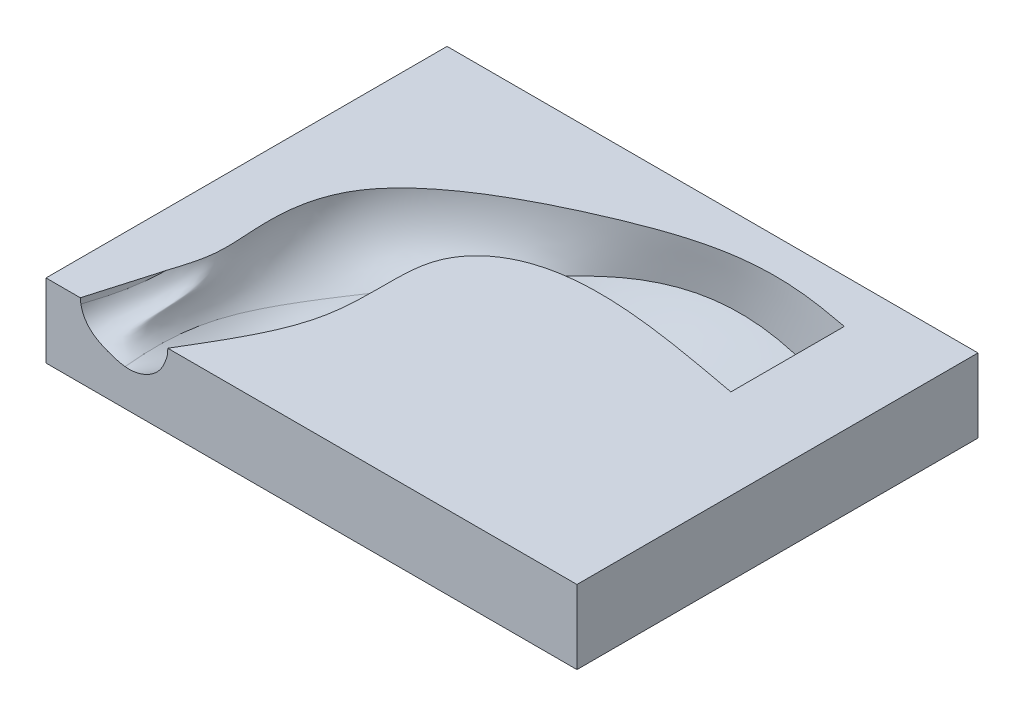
ISO-10303-21;
HEADER;
FILE_DESCRIPTION(('STEP AP214'),'2;1');
FILE_NAME('part.step','',(''),(''),'','','');
FILE_SCHEMA(('AUTOMOTIVE_DESIGN { 1 0 10303 214 1 1 1 1 }'));
ENDSEC;
DATA;
#1=APPLICATION_CONTEXT('core data for automotive mechanical design processes');
#2=APPLICATION_PROTOCOL_DEFINITION('international standard','automotive_design',2000,#1);
#3=PRODUCT_CONTEXT('',#1,'mechanical');
#4=PRODUCT('Part','Part','',(#3));
#5=PRODUCT_RELATED_PRODUCT_CATEGORY('part','',(#4));
#6=PRODUCT_DEFINITION_FORMATION('','',#4);
#7=PRODUCT_DEFINITION_CONTEXT('part definition',#1,'design');
#8=PRODUCT_DEFINITION('design','',#6,#7);
#9=PRODUCT_DEFINITION_SHAPE('','',#8);
#10=(LENGTH_UNIT() NAMED_UNIT(*) SI_UNIT(.MILLI.,.METRE.));
#11=(NAMED_UNIT(*) PLANE_ANGLE_UNIT() SI_UNIT($,.RADIAN.));
#12=(NAMED_UNIT(*) SI_UNIT($,.STERADIAN.) SOLID_ANGLE_UNIT());
#13=UNCERTAINTY_MEASURE_WITH_UNIT(LENGTH_MEASURE(1.E-05),#10,'distance_accuracy_value','');
#14=(GEOMETRIC_REPRESENTATION_CONTEXT(3) GLOBAL_UNCERTAINTY_ASSIGNED_CONTEXT((#13)) GLOBAL_UNIT_ASSIGNED_CONTEXT((#10,
#11,#12)) REPRESENTATION_CONTEXT('',''));
#15=CARTESIAN_POINT('',(0.,0.,0.));
#16=DIRECTION('',(0.,0.,1.));
#17=DIRECTION('',(1.,0.,0.));
#18=AXIS2_PLACEMENT_3D('',#15,#16,#17);
#19=CARTESIAN_POINT('',(0.,0.,-254.));
#20=DIRECTION('',(-1.,0.,0.));
#21=DIRECTION('',(0.,0.,1.));
#22=AXIS2_PLACEMENT_3D('',#19,#20,#21);
#23=PLANE('',#22);
#24=DIRECTION('',(0.,-1.,0.));
#25=VECTOR('',#24,1.);
#26=CARTESIAN_POINT('',(0.,0.,0.));
#27=LINE('',#26,#25);
#28=CARTESIAN_POINT('',(0.,46.7038200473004,0.));
#29=VERTEX_POINT('',#28);
#30=CARTESIAN_POINT('',(0.,0.,0.));
#31=VERTEX_POINT('',#30);
#32=EDGE_CURVE('E620',#29,#31,#27,.T.);
#33=ORIENTED_EDGE('',*,*,#32,.F.);
#34=DIRECTION('',(0.,0.,1.));
#35=VECTOR('',#34,1.);
#36=CARTESIAN_POINT('',(0.,46.7038200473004,-254.));
#37=LINE('',#36,#35);
#38=CARTESIAN_POINT('',(0.,46.7038200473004,-254.));
#39=VERTEX_POINT('',#38);
#40=EDGE_CURVE('E305',#39,#29,#37,.T.);
#41=ORIENTED_EDGE('',*,*,#40,.F.);
#42=DIRECTION('',(0.,-1.,0.));
#43=VECTOR('',#42,1.);
#44=CARTESIAN_POINT('',(0.,0.,-254.));
#45=LINE('',#44,#43);
#46=CARTESIAN_POINT('',(0.,0.,-254.));
#47=VERTEX_POINT('',#46);
#48=EDGE_CURVE('E522',#39,#47,#45,.T.);
#49=ORIENTED_EDGE('',*,*,#48,.T.);
#50=DIRECTION('',(0.,0.,1.));
#51=VECTOR('',#50,1.);
#52=CARTESIAN_POINT('',(0.,0.,-254.));
#53=LINE('',#52,#51);
#54=EDGE_CURVE('E333',#47,#31,#53,.T.);
#55=ORIENTED_EDGE('',*,*,#54,.T.);
#56=EDGE_LOOP('',(#33,#41,#49,#55));
#57=FACE_BOUND('',#56,.T.);
#58=ADVANCED_FACE('F279',(#57),#23,.T.);
#59=CARTESIAN_POINT('',(0.,46.7038200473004,-254.));
#60=DIRECTION('',(0.,1.,0.));
#61=DIRECTION('',(0.,0.,1.));
#62=AXIS2_PLACEMENT_3D('',#59,#60,#61);
#63=PLANE('',#62);
#64=CARTESIAN_POINT('',(33.9412956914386,46.703820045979,-42.2537964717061));
#65=CARTESIAN_POINT('',(33.822150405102,46.7038200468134,-41.8114410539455));
#66=CARTESIAN_POINT('',(33.7020773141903,46.703820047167,-41.3693366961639));
#67=CARTESIAN_POINT('',(33.4603053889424,46.7038200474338,-40.4855745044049));
#68=CARTESIAN_POINT('',(33.3386065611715,46.7038200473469,-40.0439166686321));
#69=CARTESIAN_POINT('',(32.9714192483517,46.7038200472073,-38.7195401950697));
#70=CARTESIAN_POINT('',(32.7238355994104,46.7038200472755,-37.8374025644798));
#71=CARTESIAN_POINT('',(32.2246505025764,46.7038200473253,-36.0743083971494));
#72=CARTESIAN_POINT('',(31.973049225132,46.7038200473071,-35.1933518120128));
#73=CARTESIAN_POINT('',(31.4670814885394,46.7038200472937,-33.4322291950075));
#74=CARTESIAN_POINT('',(31.2127150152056,46.7038200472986,-32.5520631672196));
#75=CARTESIAN_POINT('',(30.7022261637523,46.7038200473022,-30.7922372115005));
#76=CARTESIAN_POINT('',(30.4461037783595,46.7038200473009,-29.9125772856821));
#77=CARTESIAN_POINT('',(29.9328850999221,46.7038200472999,-28.1535415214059));
#78=CARTESIAN_POINT('',(29.67578880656,46.7038200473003,-27.2741656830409));
#79=CARTESIAN_POINT('',(29.1612088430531,46.7038200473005,-25.5155240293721));
#80=CARTESIAN_POINT('',(28.903725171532,46.7038200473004,-24.6362582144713));
#81=CARTESIAN_POINT('',(28.3887869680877,46.7038200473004,-22.8777177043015));
#82=CARTESIAN_POINT('',(28.1313324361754,46.7038200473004,-21.9984430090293));
#83=CARTESIAN_POINT('',(27.3594754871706,46.7038200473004,-19.3604929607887));
#84=CARTESIAN_POINT('',(26.8455736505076,46.7038200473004,-17.6016709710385));
#85=CARTESIAN_POINT('',(25.8202019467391,46.7038200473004,-14.083319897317));
#86=CARTESIAN_POINT('',(25.3087320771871,46.7038200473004,-12.3237908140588));
#87=CARTESIAN_POINT('',(24.2883294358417,46.7038200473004,-8.80399568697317));
#88=CARTESIAN_POINT('',(23.779396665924,46.7038200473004,-7.04372964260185));
#89=CARTESIAN_POINT('',(23.0179106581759,46.7038200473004,-4.40277625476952));
#90=CARTESIAN_POINT('',(22.7644004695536,46.7038200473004,-3.52236475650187));
#91=CARTESIAN_POINT('',(22.2580849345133,46.7038200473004,-1.76133907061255));
#92=CARTESIAN_POINT('',(22.0052795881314,46.7038200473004,-0.880724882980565));
#93=CARTESIAN_POINT('',(21.7528601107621,46.7038200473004,0.));
#94=B_SPLINE_CURVE_WITH_KNOTS('',3,(#64,#65,#66,#67,#68,#69,#70,#71,#72,#73,#74,#75,#76,#77,#78,
#79,#80,#81,#82,#83,#84,#85,#86,#87,#88,#89,#90,#91,#92,#93),.UNSPECIFIED.,.F.,.F.,(4,2,2,2,2,2,
2,2,2,2,2,2,2,2,4),(0.,1.37435722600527,2.74870890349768,5.49736245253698,8.24589969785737,
10.9944510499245,13.7430137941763,16.4915774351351,19.2401508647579,21.9887253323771,
27.4858096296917,32.9828883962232,38.4799712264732,41.2285208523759,43.9770706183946),.UNSPECIFIED.);
#95=CARTESIAN_POINT('',(33.9412956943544,46.7038200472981,-42.2537964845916));
#96=VERTEX_POINT('',#95);
#97=CARTESIAN_POINT('',(21.7528601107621,46.7038200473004,0.));
#98=VERTEX_POINT('',#97);
#99=EDGE_CURVE('E296',#96,#98,#94,.T.);
#100=ORIENTED_EDGE('',*,*,#99,.F.);
#101=CARTESIAN_POINT('',(279.4,46.7038200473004,-226.198976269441));
#102=CARTESIAN_POINT('',(278.465549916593,46.7038200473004,-226.372447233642));
#103=CARTESIAN_POINT('',(277.531091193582,46.7038200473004,-226.545881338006));
#104=CARTESIAN_POINT('',(275.661656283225,46.7038200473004,-226.891250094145));
#105=CARTESIAN_POINT('',(274.726680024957,46.7038200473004,-227.063184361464));
#106=CARTESIAN_POINT('',(272.54378348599,46.7038200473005,-227.460965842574));
#107=CARTESIAN_POINT('',(271.295647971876,46.7038200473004,-227.68563853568));
#108=CARTESIAN_POINT('',(268.797854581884,46.7038200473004,-228.126326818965));
#109=CARTESIAN_POINT('',(267.548196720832,46.7038200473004,-228.342342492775));
#110=CARTESIAN_POINT('',(265.046983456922,46.7038200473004,-228.76264927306));
#111=CARTESIAN_POINT('',(263.795428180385,46.7038200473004,-228.966941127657));
#112=CARTESIAN_POINT('',(261.290261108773,46.7038200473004,-229.360988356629));
#113=CARTESIAN_POINT('',(260.036649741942,46.7038200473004,-229.550746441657));
#114=CARTESIAN_POINT('',(257.526865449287,46.7038200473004,-229.91326983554));
#115=CARTESIAN_POINT('',(256.270692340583,46.7038200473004,-230.086033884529));
#116=CARTESIAN_POINT('',(253.755495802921,46.7038200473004,-230.412362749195));
#117=CARTESIAN_POINT('',(252.496471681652,46.7038200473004,-230.565922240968));
#118=CARTESIAN_POINT('',(249.609103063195,46.7038200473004,-230.893413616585));
#119=CARTESIAN_POINT('',(247.979945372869,46.7038200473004,-231.06026201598));
#120=CARTESIAN_POINT('',(244.717526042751,46.7038200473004,-231.354921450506));
#121=CARTESIAN_POINT('',(243.084263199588,46.7038200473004,-231.482719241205));
#122=CARTESIAN_POINT('',(239.814861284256,46.7038200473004,-231.696143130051));
#123=CARTESIAN_POINT('',(238.178722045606,46.7038200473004,-231.781766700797));
#124=CARTESIAN_POINT('',(234.904825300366,46.7038200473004,-231.908292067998));
#125=CARTESIAN_POINT('',(233.267067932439,46.7038200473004,-231.949197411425));
#126=CARTESIAN_POINT('',(229.991210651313,46.7038200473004,-231.984266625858));
#127=CARTESIAN_POINT('',(228.353110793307,46.7038200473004,-231.978435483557));
#128=CARTESIAN_POINT('',(225.077864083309,46.7038200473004,-231.918511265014));
#129=CARTESIAN_POINT('',(223.440717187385,46.7038200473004,-231.864420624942));
#130=CARTESIAN_POINT('',(220.16522442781,46.7038200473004,-231.706791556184));
#131=CARTESIAN_POINT('',(218.526883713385,46.7038200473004,-231.603145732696));
#132=CARTESIAN_POINT('',(215.253830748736,46.7038200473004,-231.345871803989));
#133=CARTESIAN_POINT('',(213.619119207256,46.7038200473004,-231.192234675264));
#134=CARTESIAN_POINT('',(210.3550224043,46.7038200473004,-230.835099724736));
#135=CARTESIAN_POINT('',(208.725637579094,46.7038200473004,-230.631597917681));
#136=CARTESIAN_POINT('',(205.473801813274,46.7038200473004,-230.175506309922));
#137=CARTESIAN_POINT('',(203.8513507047,46.7038200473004,-229.922917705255));
#138=CARTESIAN_POINT('',(200.61489824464,46.7038200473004,-229.370100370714));
#139=CARTESIAN_POINT('',(199.000895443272,46.7038200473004,-229.069880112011));
#140=CARTESIAN_POINT('',(195.782751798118,46.7038200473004,-228.423918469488));
#141=CARTESIAN_POINT('',(194.17860706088,46.7038200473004,-228.078196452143));
#142=CARTESIAN_POINT('',(191.207922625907,46.7038200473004,-227.396000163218));
#143=CARTESIAN_POINT('',(189.84006995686,46.7038200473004,-227.06521684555));
#144=CARTESIAN_POINT('',(187.11187878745,46.7038200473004,-226.373878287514));
#145=CARTESIAN_POINT('',(185.751540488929,46.7038200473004,-226.013322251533));
#146=CARTESIAN_POINT('',(183.038439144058,46.7038200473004,-225.264502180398));
#147=CARTESIAN_POINT('',(181.685676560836,46.7038200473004,-224.876236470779));
#148=CARTESIAN_POINT('',(178.987705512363,46.7038200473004,-224.074203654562));
#149=CARTESIAN_POINT('',(177.642497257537,46.7038200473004,-223.660435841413));
#150=CARTESIAN_POINT('',(174.958262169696,46.7038200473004,-222.809271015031));
#151=CARTESIAN_POINT('',(173.619241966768,46.7038200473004,-222.371853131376));
#152=CARTESIAN_POINT('',(170.94829823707,46.7038200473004,-221.475958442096));
#153=CARTESIAN_POINT('',(169.61637461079,46.7038200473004,-221.017481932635));
#154=CARTESIAN_POINT('',(166.957744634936,46.7038200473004,-220.081081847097));
#155=CARTESIAN_POINT('',(165.631045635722,46.7038200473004,-219.603137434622));
#156=CARTESIAN_POINT('',(162.983898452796,46.7038200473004,-218.630267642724));
#157=CARTESIAN_POINT('',(161.663450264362,46.7038200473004,-218.135342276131));
#158=CARTESIAN_POINT('',(159.027308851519,46.7038200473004,-217.129921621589));
#159=CARTESIAN_POINT('',(157.71162019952,46.7038200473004,-216.619414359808));
#160=CARTESIAN_POINT('',(155.085602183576,46.7038200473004,-215.584795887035));
#161=CARTESIAN_POINT('',(153.775272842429,46.7038200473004,-215.060684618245));
#162=CARTESIAN_POINT('',(151.159314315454,46.7038200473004,-214.000152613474));
#163=CARTESIAN_POINT('',(149.85368608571,46.7038200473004,-213.463729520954));
#164=CARTESIAN_POINT('',(147.247212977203,46.7038200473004,-212.379391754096));
#165=CARTESIAN_POINT('',(145.946368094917,46.7038200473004,-211.831477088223));
#166=CARTESIAN_POINT('',(143.342464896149,46.7038200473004,-210.721518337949));
#167=CARTESIAN_POINT('',(142.039432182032,46.7038200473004,-210.159414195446));
#168=CARTESIAN_POINT('',(139.438264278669,46.7038200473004,-209.023986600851));
#169=CARTESIAN_POINT('',(138.140129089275,46.7038200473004,-208.4506631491));
#170=CARTESIAN_POINT('',(135.55004987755,46.7038200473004,-207.293130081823));
#171=CARTESIAN_POINT('',(134.258101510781,46.7038200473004,-206.708930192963));
#172=CARTESIAN_POINT('',(131.679556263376,46.7038200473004,-205.528835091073));
#173=CARTESIAN_POINT('',(130.392959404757,46.7038200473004,-204.932939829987));
#174=CARTESIAN_POINT('',(126.543823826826,46.7038200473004,-203.128051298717));
#175=CARTESIAN_POINT('',(123.989764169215,46.7038200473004,-201.900884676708));
#176=CARTESIAN_POINT('',(118.909724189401,46.7038200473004,-199.394232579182));
#177=CARTESIAN_POINT('',(116.383724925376,46.7038200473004,-198.114785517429));
#178=CARTESIAN_POINT('',(111.363591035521,46.7038200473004,-195.497425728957));
#179=CARTESIAN_POINT('',(108.869441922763,46.7038200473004,-194.159540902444));
#180=CARTESIAN_POINT('',(105.155559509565,46.7038200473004,-192.103405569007));
#181=CARTESIAN_POINT('',(103.922144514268,46.7038200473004,-191.409802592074));
#182=CARTESIAN_POINT('',(101.465272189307,46.7038200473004,-190.005191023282));
#183=CARTESIAN_POINT('',(100.241814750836,46.7038200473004,-189.294182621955));
#184=CARTESIAN_POINT('',(97.5007561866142,46.7038200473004,-187.673373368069));
#185=CARTESIAN_POINT('',(95.9862197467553,46.7038200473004,-186.758378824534));
#186=CARTESIAN_POINT('',(92.9759614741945,46.7038200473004,-184.897189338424));
#187=CARTESIAN_POINT('',(91.4802438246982,46.7038200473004,-183.950987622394));
#188=CARTESIAN_POINT('',(88.5102232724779,46.7038200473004,-182.024980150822));
#189=CARTESIAN_POINT('',(87.0359238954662,46.7038200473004,-181.045168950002));
#190=CARTESIAN_POINT('',(84.1116124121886,46.7038200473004,-179.049122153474));
#191=CARTESIAN_POINT('',(82.6616064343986,46.7038200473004,-178.032877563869));
#192=CARTESIAN_POINT('',(79.7949647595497,46.7038200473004,-175.96483460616));
#193=CARTESIAN_POINT('',(78.3782286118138,46.7038200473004,-174.913175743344));
#194=CARTESIAN_POINT('',(75.577196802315,46.7038200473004,-172.767563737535));
#195=CARTESIAN_POINT('',(74.1928994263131,46.7038200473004,-171.673612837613));
#196=CARTESIAN_POINT('',(71.4623521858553,46.7038200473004,-169.439897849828));
#197=CARTESIAN_POINT('',(70.1160914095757,46.7038200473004,-168.300147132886));
#198=CARTESIAN_POINT('',(67.4678716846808,46.7038200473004,-165.97044324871));
#199=CARTESIAN_POINT('',(66.1659069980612,46.7038200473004,-164.7804966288));
#200=CARTESIAN_POINT('',(63.8149065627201,46.7038200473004,-162.537063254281));
#201=CARTESIAN_POINT('',(62.7582871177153,46.7038200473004,-161.491535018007));
#202=CARTESIAN_POINT('',(60.6883218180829,46.7038200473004,-159.358525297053));
#203=CARTESIAN_POINT('',(59.6749727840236,46.7038200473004,-158.27104690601));
#204=CARTESIAN_POINT('',(57.69864272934,46.7038200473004,-156.050833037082));
#205=CARTESIAN_POINT('',(56.7356653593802,46.7038200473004,-154.918094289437));
#206=CARTESIAN_POINT('',(55.3368835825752,46.7038200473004,-153.184240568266));
#207=CARTESIAN_POINT('',(54.8786833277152,46.7038200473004,-152.601113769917));
#208=CARTESIAN_POINT('',(53.9783833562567,46.7038200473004,-151.422529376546));
#209=CARTESIAN_POINT('',(53.5362837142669,46.7038200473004,-150.827071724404));
#210=CARTESIAN_POINT('',(52.6696216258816,46.7038200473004,-149.623555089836));
#211=CARTESIAN_POINT('',(52.2450581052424,46.7038200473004,-149.015496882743));
#212=CARTESIAN_POINT('',(51.6225220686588,46.7038200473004,-148.093775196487));
#213=CARTESIAN_POINT('',(51.4173944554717,46.7038200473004,-147.784928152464));
#214=CARTESIAN_POINT('',(51.0121184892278,46.7038200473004,-147.16398457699));
#215=CARTESIAN_POINT('',(50.8119701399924,46.7038200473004,-146.851888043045));
#216=CARTESIAN_POINT('',(50.2192056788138,46.7038200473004,-145.910930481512));
#217=CARTESIAN_POINT('',(49.8341766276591,46.7038200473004,-145.277263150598));
#218=CARTESIAN_POINT('',(49.0849096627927,46.7038200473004,-143.997727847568));
#219=CARTESIAN_POINT('',(48.7206731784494,46.7038200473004,-143.351859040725));
#220=CARTESIAN_POINT('',(47.8311024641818,46.7038200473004,-141.712519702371));
#221=CARTESIAN_POINT('',(47.319539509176,46.7038200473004,-140.711530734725));
#222=CARTESIAN_POINT('',(46.3463248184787,46.7038200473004,-138.68552927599));
#223=CARTESIAN_POINT('',(45.8846770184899,46.7038200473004,-137.660514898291));
#224=CARTESIAN_POINT('',(45.0116825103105,46.7038200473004,-135.589103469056));
#225=CARTESIAN_POINT('',(44.6003436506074,46.7038200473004,-134.542703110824));
#226=CARTESIAN_POINT('',(43.8278525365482,46.7038200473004,-132.431591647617));
#227=CARTESIAN_POINT('',(43.4666992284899,46.7038200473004,-131.366880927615));
#228=CARTESIAN_POINT('',(42.7935827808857,46.7038200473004,-129.221579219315));
#229=CARTESIAN_POINT('',(42.4816396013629,46.7038200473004,-128.140981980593));
#230=CARTESIAN_POINT('',(41.9056794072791,46.7038200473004,-125.967102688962));
#231=CARTESIAN_POINT('',(41.6416633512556,46.7038200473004,-124.87382038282));
#232=CARTESIAN_POINT('',(41.1595704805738,46.7038200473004,-122.676994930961));
#233=CARTESIAN_POINT('',(40.9415022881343,46.7038200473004,-121.573449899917));
#234=CARTESIAN_POINT('',(40.5489942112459,46.7038200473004,-119.358728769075));
#235=CARTESIAN_POINT('',(40.3745521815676,46.7038200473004,-118.247553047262));
#236=CARTESIAN_POINT('',(40.0475834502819,46.7038200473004,-115.882444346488));
#237=CARTESIAN_POINT('',(39.9003974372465,46.7038200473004,-114.627775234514));
#238=CARTESIAN_POINT('',(39.6532707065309,46.7038200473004,-112.113693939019));
#239=CARTESIAN_POINT('',(39.5533362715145,46.7038200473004,-110.854281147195));
#240=CARTESIAN_POINT('',(39.3960560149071,46.7038200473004,-108.332512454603));
#241=CARTESIAN_POINT('',(39.3387216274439,46.7038200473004,-107.070155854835));
#242=CARTESIAN_POINT('',(39.2617006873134,46.7038200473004,-104.544329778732));
#243=CARTESIAN_POINT('',(39.2420146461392,46.7038200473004,-103.280860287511));
#244=CARTESIAN_POINT('',(39.234956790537,46.7038200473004,-100.754655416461));
#245=CARTESIAN_POINT('',(39.247565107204,46.7038200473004,-99.4919200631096));
#246=CARTESIAN_POINT('',(39.2993143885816,46.7038200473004,-96.963631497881));
#247=CARTESIAN_POINT('',(39.3385267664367,46.7038200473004,-95.6980798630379));
#248=CARTESIAN_POINT('',(39.4369674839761,46.7038200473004,-93.1683347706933));
#249=CARTESIAN_POINT('',(39.4961872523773,46.7038200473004,-91.904140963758));
#250=CARTESIAN_POINT('',(39.5941737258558,46.7038200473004,-90.0083952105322));
#251=CARTESIAN_POINT('',(39.6283605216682,46.7038200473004,-89.3765952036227));
#252=CARTESIAN_POINT('',(39.698629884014,46.7038200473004,-88.1131001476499));
#253=CARTESIAN_POINT('',(39.7347124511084,46.7038200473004,-87.4814050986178));
#254=CARTESIAN_POINT('',(39.8075002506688,46.7038200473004,-86.2180026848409));
#255=CARTESIAN_POINT('',(39.8442055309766,46.7038200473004,-85.5862953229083));
#256=CARTESIAN_POINT('',(39.9167727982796,46.7038200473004,-84.3228303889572));
#257=CARTESIAN_POINT('',(39.9526347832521,46.7038200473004,-83.6910728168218));
#258=CARTESIAN_POINT('',(40.0218426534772,46.7038200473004,-82.4272896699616));
#259=CARTESIAN_POINT('',(40.0551880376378,46.7038200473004,-81.7952640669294));
#260=CARTESIAN_POINT('',(40.1174186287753,46.7038200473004,-80.5309987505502));
#261=CARTESIAN_POINT('',(40.1463038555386,46.7038200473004,-79.8987590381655));
#262=CARTESIAN_POINT('',(40.2137874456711,46.7038200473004,-78.2280899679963));
#263=CARTESIAN_POINT('',(40.2467210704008,46.7038200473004,-77.1894010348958));
#264=CARTESIAN_POINT('',(40.274363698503,46.7038200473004,-75.631068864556));
#265=CARTESIAN_POINT('',(40.2799520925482,46.7038200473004,-75.1116227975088));
#266=CARTESIAN_POINT('',(40.2824894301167,46.7038200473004,-74.072714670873));
#267=CARTESIAN_POINT('',(40.2794386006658,46.7038200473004,-73.5532526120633));
#268=CARTESIAN_POINT('',(40.2634121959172,46.7038200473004,-72.5148956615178));
#269=CARTESIAN_POINT('',(40.2504446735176,46.7038200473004,-71.9960006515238));
#270=CARTESIAN_POINT('',(40.2135109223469,46.7038200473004,-70.9585968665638));
#271=CARTESIAN_POINT('',(40.1895447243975,46.7038200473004,-70.4400880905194));
#272=CARTESIAN_POINT('',(40.1298681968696,46.7038200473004,-69.4039369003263));
#273=CARTESIAN_POINT('',(40.0941622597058,46.7038200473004,-68.8862942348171));
#274=CARTESIAN_POINT('',(40.0106659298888,46.7038200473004,-67.8519847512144));
#275=CARTESIAN_POINT('',(39.9628755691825,46.7038200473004,-67.3353179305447));
#276=CARTESIAN_POINT('',(39.8552909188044,46.7038200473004,-66.3029273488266));
#277=CARTESIAN_POINT('',(39.7954895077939,46.7038200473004,-65.7872043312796));
#278=CARTESIAN_POINT('',(39.6644174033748,46.7038200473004,-64.7572181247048));
#279=CARTESIAN_POINT('',(39.5931466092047,46.7038200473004,-64.2429549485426));
#280=CARTESIAN_POINT('',(39.4398787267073,46.7038200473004,-63.2154394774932));
#281=CARTESIAN_POINT('',(39.3578695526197,46.7038200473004,-62.7021889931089));
#282=CARTESIAN_POINT('',(39.1841466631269,46.7038200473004,-61.6773369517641));
#283=CARTESIAN_POINT('',(39.0924329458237,46.7038200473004,-61.1657353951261));
#284=CARTESIAN_POINT('',(38.8978898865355,46.7038200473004,-60.1353375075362));
#285=CARTESIAN_POINT('',(38.7948935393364,46.7038200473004,-59.6165727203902));
#286=CARTESIAN_POINT('',(38.5795181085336,46.7038200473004,-58.5810002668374));
#287=CARTESIAN_POINT('',(38.4671390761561,46.7038200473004,-58.0641925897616));
#288=CARTESIAN_POINT('',(38.2333992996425,46.7038200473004,-57.0319558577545));
#289=CARTESIAN_POINT('',(38.1120278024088,46.7038200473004,-56.5165292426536));
#290=CARTESIAN_POINT('',(37.8614324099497,46.7038200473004,-55.4875922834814));
#291=CARTESIAN_POINT('',(37.7322084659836,46.7038200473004,-54.9740819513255));
#292=CARTESIAN_POINT('',(37.3337167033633,46.7038200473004,-53.434671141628));
#293=CARTESIAN_POINT('',(37.0539931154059,46.7038200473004,-52.4114731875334));
#294=CARTESIAN_POINT('',(36.4731357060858,46.7038200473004,-50.3697186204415));
#295=CARTESIAN_POINT('',(36.1719729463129,46.7038200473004,-49.3511703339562));
#296=CARTESIAN_POINT('',(35.5544137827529,46.7038200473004,-47.3178271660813));
#297=CARTESIAN_POINT('',(35.2380052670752,46.7038200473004,-46.3030359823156));
#298=CARTESIAN_POINT('',(34.756211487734,46.7038200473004,-44.7831360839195));
#299=CARTESIAN_POINT('',(34.5944156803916,46.7038200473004,-44.2768807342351));
#300=CARTESIAN_POINT('',(34.2690413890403,46.7038200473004,-43.2649519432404));
#301=CARTESIAN_POINT('',(34.1054629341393,46.7038200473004,-42.7592784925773));
#302=CARTESIAN_POINT('',(33.9412956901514,46.7038200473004,-42.2537964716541));
#303=B_SPLINE_CURVE_WITH_KNOTS('',3,(#101,#102,#103,#104,#105,#106,#107,#108,#109,#110,#111,
#112,#113,#114,#115,#116,#117,#118,#119,#120,#121,#122,#123,#124,#125,#126,#127,#128,#129,#130,
#131,#132,#133,#134,#135,#136,#137,#138,#139,#140,#141,#142,#143,#144,#145,#146,#147,#148,#149,
#150,#151,#152,#153,#154,#155,#156,#157,#158,#159,#160,#161,#162,#163,#164,#165,#166,#167,#168,
#169,#170,#171,#172,#173,#174,#175,#176,#177,#178,#179,#180,#181,#182,#183,#184,#185,#186,#187,
#188,#189,#190,#191,#192,#193,#194,#195,#196,#197,#198,#199,#200,#201,#202,#203,#204,#205,#206,
#207,#208,#209,#210,#211,#212,#213,#214,#215,#216,#217,#218,#219,#220,#221,#222,#223,#224,#225,
#226,#227,#228,#229,#230,#231,#232,#233,#234,#235,#236,#237,#238,#239,#240,#241,#242,#243,#244,
#245,#246,#247,#248,#249,#250,#251,#252,#253,#254,#255,#256,#257,#258,#259,#260,#261,#262,#263,
#264,#265,#266,#267,#268,#269,#270,#271,#272,#273,#274,#275,#276,#277,#278,#279,#280,#281,#282,
#283,#284,#285,#286,#287,#288,#289,#290,#291,#292,#293,#294,#295,#296,#297,#298,#299,#300,#301,
#302),.UNSPECIFIED.,.F.,.F.,(4,2,2,2,2,2,2,2,2,2,2,2,2,2,2,2,2,2,2,2,2,2,2,2,2,2,2,2,2,2,2,2,2,
2,2,2,2,2,2,2,2,2,2,2,2,2,2,2,2,2,2,2,2,2,2,2,2,2,2,2,2,2,2,2,2,2,2,2,2,2,2,2,2,2,2,2,2,2,2,2,2,
2,2,2,2,2,2,2,2,2,2,2,2,2,2,2,2,2,2,2,4),(0.,2.85124850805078,5.7032075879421,9.50777461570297,
13.3123048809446,17.116592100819,20.9201680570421,24.7240257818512,28.5289356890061,
33.4415308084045,38.3557902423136,43.2703441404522,48.1845081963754,53.0981479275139,
58.0115396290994,62.9356281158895,67.8606059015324,72.7859774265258,77.7112289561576,
82.6356055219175,87.5578929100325,91.7793919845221,96.0010039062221,100.222871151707,
104.444855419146,108.670628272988,112.896341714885,117.126703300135,121.357061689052,
125.590757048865,129.824470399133,134.059000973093,138.293528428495,142.55078671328,
146.808044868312,151.06166310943,155.315298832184,163.815423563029,172.309411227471,
180.799386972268,185.04445187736,189.289470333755,194.5975385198,199.906766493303,
205.21685874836,210.528270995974,215.820767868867,221.112984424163,226.40366702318,
231.693661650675,236.151974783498,240.609959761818,245.06826738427,247.292865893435,
249.517474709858,251.741947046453,252.854188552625,253.966430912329,256.190414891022,
258.414551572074,261.785488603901,265.156691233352,268.528419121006,271.900076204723,
275.273097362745,278.646185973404,282.019906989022,285.393462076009,289.18227501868,
292.971591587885,296.761924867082,300.552309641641,304.340362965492,308.138624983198,
311.935261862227,313.833433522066,315.731605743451,317.629924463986,319.528247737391,
321.426948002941,323.325639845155,326.442953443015,328.001323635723,329.559652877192,
331.116718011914,332.673778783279,334.230257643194,335.78673238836,337.344132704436,
338.901546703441,340.460728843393,342.019911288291,343.60649176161,345.193063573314,
346.781564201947,348.370074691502,351.551964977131,354.738234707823,357.927078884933,
359.52152115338,361.115937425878),.UNSPECIFIED.);
#304=CARTESIAN_POINT('',(279.4,46.7038200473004,-226.198976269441));
#305=VERTEX_POINT('',#304);
#306=EDGE_CURVE('E499',#305,#96,#303,.T.);
#307=ORIENTED_EDGE('',*,*,#306,.F.);
#308=DIRECTION('',(0.,0.,-1.));
#309=VECTOR('',#308,1.);
#310=CARTESIAN_POINT('',(279.4,46.7038200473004,-254.));
#311=LINE('',#310,#309);
#312=CARTESIAN_POINT('',(279.4,46.7038200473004,-154.346744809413));
#313=VERTEX_POINT('',#312);
#314=EDGE_CURVE('E12',#313,#305,#311,.T.);
#315=ORIENTED_EDGE('',*,*,#314,.F.);
#316=CARTESIAN_POINT('',(77.1432653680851,46.7038200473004,0.));
#317=CARTESIAN_POINT('',(77.4881066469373,46.7038200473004,-0.590470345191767));
#318=CARTESIAN_POINT('',(77.833884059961,46.7038200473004,-1.18039219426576));
#319=CARTESIAN_POINT('',(78.5267929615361,46.7038200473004,-2.35943783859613));
#320=CARTESIAN_POINT('',(78.8739244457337,46.7038200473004,-2.94856163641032));
#321=CARTESIAN_POINT('',(79.9170002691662,46.7038200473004,-4.71590881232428));
#322=CARTESIAN_POINT('',(80.6142038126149,46.7038200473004,-5.89338799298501));
#323=CARTESIAN_POINT('',(82.0084450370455,46.7038200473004,-8.24911962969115));
#324=CARTESIAN_POINT('',(82.7054825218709,46.7038200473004,-9.42737220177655));
#325=CARTESIAN_POINT('',(84.0964496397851,46.7038200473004,-11.7861007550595));
#326=CARTESIAN_POINT('',(84.7903784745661,46.7038200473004,-12.9665772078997));
#327=CARTESIAN_POINT('',(86.1723565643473,46.7038200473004,-15.3311032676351));
#328=CARTESIAN_POINT('',(86.8604053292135,46.7038200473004,-16.5151531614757));
#329=CARTESIAN_POINT('',(88.2279368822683,46.7038200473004,-18.8881260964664));
#330=CARTESIAN_POINT('',(88.9074200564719,46.7038200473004,-20.0770489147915));
#331=CARTESIAN_POINT('',(90.2619607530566,46.7038200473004,-22.4730989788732));
#332=CARTESIAN_POINT('',(90.9369065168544,46.7038200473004,-23.6802895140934));
#333=CARTESIAN_POINT('',(92.2725654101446,46.7038200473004,-26.1023399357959));
#334=CARTESIAN_POINT('',(92.9332802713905,46.7038200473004,-27.3171988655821));
#335=CARTESIAN_POINT('',(94.2376073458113,46.7038200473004,-29.7560146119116));
#336=CARTESIAN_POINT('',(94.8812202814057,46.7038200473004,-30.9799710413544));
#337=CARTESIAN_POINT('',(96.1483223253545,46.7038200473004,-33.4384888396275));
#338=CARTESIAN_POINT('',(96.7718086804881,46.7038200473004,-34.6730516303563));
#339=CARTESIAN_POINT('',(97.99542915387,46.7038200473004,-37.1543976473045));
#340=CARTESIAN_POINT('',(98.5955528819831,46.7038200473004,-38.4011860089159));
#341=CARTESIAN_POINT('',(99.768947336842,46.7038200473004,-40.908739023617));
#342=CARTESIAN_POINT('',(100.34219332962,46.7038200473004,-42.1695152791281));
#343=CARTESIAN_POINT('',(101.473146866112,46.7038200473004,-44.741437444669));
#344=CARTESIAN_POINT('',(102.029933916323,46.7038200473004,-46.0529893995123));
#345=CARTESIAN_POINT('',(103.105304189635,46.7038200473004,-48.6923381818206));
#346=CARTESIAN_POINT('',(103.623871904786,46.7038200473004,-50.0201413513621));
#347=CARTESIAN_POINT('',(104.61669714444,46.7038200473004,-52.6914815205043));
#348=CARTESIAN_POINT('',(105.090977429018,46.7038200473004,-54.0350100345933));
#349=CARTESIAN_POINT('',(105.988904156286,46.7038200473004,-56.7374512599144));
#350=CARTESIAN_POINT('',(106.412603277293,46.7038200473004,-58.096346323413));
#351=CARTESIAN_POINT('',(107.005271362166,46.7038200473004,-60.1462254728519));
#352=CARTESIAN_POINT('',(107.195592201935,46.7038200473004,-60.8310797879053));
#353=CARTESIAN_POINT('',(107.561163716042,46.7038200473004,-62.2048067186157));
#354=CARTESIAN_POINT('',(107.736414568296,46.7038200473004,-62.8936792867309));
#355=CARTESIAN_POINT('',(108.070751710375,46.7038200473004,-64.2748162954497));
#356=CARTESIAN_POINT('',(108.229849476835,46.7038200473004,-64.9670779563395));
#357=CARTESIAN_POINT('',(108.532423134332,46.7038200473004,-66.3549988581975));
#358=CARTESIAN_POINT('',(108.675898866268,46.7038200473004,-67.0506581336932));
#359=CARTESIAN_POINT('',(109.081516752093,46.7038200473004,-69.130914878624));
#360=CARTESIAN_POINT('',(109.321512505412,46.7038200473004,-70.5198806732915));
#361=CARTESIAN_POINT('',(109.747077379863,46.7038200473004,-73.3072575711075));
#362=CARTESIAN_POINT('',(109.932598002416,46.7038200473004,-74.7056759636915));
#363=CARTESIAN_POINT('',(110.25484177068,46.7038200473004,-77.5097142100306));
#364=CARTESIAN_POINT('',(110.391507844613,46.7038200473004,-78.9153405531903));
#365=CARTESIAN_POINT('',(110.622280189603,46.7038200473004,-81.7314175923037));
#366=CARTESIAN_POINT('',(110.716343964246,46.7038200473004,-83.1418716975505));
#367=CARTESIAN_POINT('',(110.868820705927,46.7038200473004,-85.9651932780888));
#368=CARTESIAN_POINT('',(110.92721980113,46.7038200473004,-87.3780614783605));
#369=CARTESIAN_POINT('',(111.015966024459,46.7038200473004,-90.2037372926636));
#370=CARTESIAN_POINT('',(111.046330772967,46.7038200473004,-91.6165443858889));
#371=CARTESIAN_POINT('',(111.079610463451,46.7038200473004,-93.9045246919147));
#372=CARTESIAN_POINT('',(111.088574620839,46.7038200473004,-94.779624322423));
#373=CARTESIAN_POINT('',(111.101116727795,46.7038200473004,-96.5291699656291));
#374=CARTESIAN_POINT('',(111.104698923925,46.7038200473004,-97.4036159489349));
#375=CARTESIAN_POINT('',(111.108756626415,46.7038200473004,-99.1521575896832));
#376=CARTESIAN_POINT('',(111.109233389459,46.7038200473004,-100.026253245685));
#377=CARTESIAN_POINT('',(111.109518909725,46.7038200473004,-101.774402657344));
#378=CARTESIAN_POINT('',(111.109327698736,46.7038200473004,-102.648456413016));
#379=CARTESIAN_POINT('',(111.11091729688,46.7038200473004,-104.401792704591));
#380=CARTESIAN_POINT('',(111.112709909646,46.7038200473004,-105.281075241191));
#381=CARTESIAN_POINT('',(111.121217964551,46.7038200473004,-107.039791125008));
#382=CARTESIAN_POINT('',(111.127934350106,46.7038200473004,-107.919224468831));
#383=CARTESIAN_POINT('',(111.149526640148,46.7038200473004,-109.678121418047));
#384=CARTESIAN_POINT('',(111.164403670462,46.7038200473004,-110.55758501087));
#385=CARTESIAN_POINT('',(111.205912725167,46.7038200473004,-112.316428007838));
#386=CARTESIAN_POINT('',(111.232547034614,46.7038200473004,-113.195807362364));
#387=CARTESIAN_POINT('',(111.290467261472,46.7038200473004,-114.670463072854));
#388=CARTESIAN_POINT('',(111.317483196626,46.7038200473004,-115.265905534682));
#389=CARTESIAN_POINT('',(111.380144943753,46.7038200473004,-116.456334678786));
#390=CARTESIAN_POINT('',(111.415790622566,46.7038200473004,-117.051321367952));
#391=CARTESIAN_POINT('',(111.497195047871,46.7038200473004,-118.240568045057));
#392=CARTESIAN_POINT('',(111.542953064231,46.7038200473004,-118.834828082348));
#393=CARTESIAN_POINT('',(111.646189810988,46.7038200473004,-120.022340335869));
#394=CARTESIAN_POINT('',(111.703668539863,46.7038200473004,-120.615592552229));
#395=CARTESIAN_POINT('',(111.832103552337,46.7038200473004,-121.800932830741));
#396=CARTESIAN_POINT('',(111.903066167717,46.7038200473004,-122.393020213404));
#397=CARTESIAN_POINT('',(112.060296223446,46.7038200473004,-123.575154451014));
#398=CARTESIAN_POINT('',(112.146563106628,46.7038200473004,-124.165201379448));
#399=CARTESIAN_POINT('',(112.335581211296,46.7038200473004,-125.337703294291));
#400=CARTESIAN_POINT('',(112.438191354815,46.7038200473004,-125.920180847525));
#401=CARTESIAN_POINT('',(112.662381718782,46.7038200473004,-127.081492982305));
#402=CARTESIAN_POINT('',(112.783961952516,46.7038200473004,-127.6603275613));
#403=CARTESIAN_POINT('',(113.048084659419,46.7038200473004,-128.812981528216));
#404=CARTESIAN_POINT('',(113.190618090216,46.7038200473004,-129.386802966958));
#405=CARTESIAN_POINT('',(113.421663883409,46.7038200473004,-130.242852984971));
#406=CARTESIAN_POINT('',(113.501554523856,46.7038200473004,-130.527426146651));
#407=CARTESIAN_POINT('',(113.667347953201,46.7038200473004,-131.094820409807));
#408=CARTESIAN_POINT('',(113.753250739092,46.7038200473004,-131.377641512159));
#409=CARTESIAN_POINT('',(113.931013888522,46.7038200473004,-131.941105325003));
#410=CARTESIAN_POINT('',(114.022868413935,46.7038200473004,-132.221749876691));
#411=CARTESIAN_POINT('',(114.212599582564,46.7038200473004,-132.780991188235));
#412=CARTESIAN_POINT('',(114.310476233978,46.7038200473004,-133.059587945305));
#413=CARTESIAN_POINT('',(114.61313705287,46.7038200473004,-133.892112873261));
#414=CARTESIAN_POINT('',(114.826956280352,46.7038200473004,-134.442789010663));
#415=CARTESIAN_POINT('',(115.281568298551,46.7038200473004,-135.541780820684));
#416=CARTESIAN_POINT('',(115.522692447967,46.7038200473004,-136.089959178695));
#417=CARTESIAN_POINT('',(116.029092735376,46.7038200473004,-137.17504430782));
#418=CARTESIAN_POINT('',(116.294368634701,46.7038200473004,-137.711951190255));
#419=CARTESIAN_POINT('',(116.848622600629,46.7038200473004,-138.773583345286));
#420=CARTESIAN_POINT('',(117.137607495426,46.7038200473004,-139.29830505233));
#421=CARTESIAN_POINT('',(117.738544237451,46.7038200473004,-140.334432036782));
#422=CARTESIAN_POINT('',(118.050496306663,46.7038200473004,-140.845837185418));
#423=CARTESIAN_POINT('',(118.697634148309,46.7038200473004,-141.856107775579));
#424=CARTESIAN_POINT('',(119.03289319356,46.7038200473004,-142.354926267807));
#425=CARTESIAN_POINT('',(119.724813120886,46.7038200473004,-143.337485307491));
#426=CARTESIAN_POINT('',(120.081474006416,46.7038200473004,-143.821225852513));
#427=CARTESIAN_POINT('',(120.81513277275,46.7038200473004,-144.772882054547));
#428=CARTESIAN_POINT('',(121.192126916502,46.7038200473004,-145.24080059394));
#429=CARTESIAN_POINT('',(121.965483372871,46.7038200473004,-146.160410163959));
#430=CARTESIAN_POINT('',(122.361847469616,46.7038200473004,-146.612099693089));
#431=CARTESIAN_POINT('',(123.169954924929,46.7038200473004,-147.495672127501));
#432=CARTESIAN_POINT('',(123.581570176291,46.7038200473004,-147.927672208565));
#433=CARTESIAN_POINT('',(124.421684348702,46.7038200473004,-148.774955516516));
#434=CARTESIAN_POINT('',(124.850184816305,46.7038200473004,-149.190237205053));
#435=CARTESIAN_POINT('',(126.15927774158,46.7038200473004,-150.410625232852));
#436=CARTESIAN_POINT('',(127.063636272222,46.7038200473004,-151.19046454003));
#437=CARTESIAN_POINT('',(128.925891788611,46.7038200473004,-152.681539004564));
#438=CARTESIAN_POINT('',(129.883752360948,46.7038200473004,-153.392819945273));
#439=CARTESIAN_POINT('',(131.845612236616,46.7038200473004,-154.74869420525));
#440=CARTESIAN_POINT('',(132.84961699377,46.7038200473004,-155.39327961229));
#441=CARTESIAN_POINT('',(134.949659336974,46.7038200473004,-156.649673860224));
#442=CARTESIAN_POINT('',(136.047765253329,46.7038200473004,-157.258015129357));
#443=CARTESIAN_POINT('',(138.279615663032,46.7038200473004,-158.406425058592));
#444=CARTESIAN_POINT('',(139.413376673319,46.7038200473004,-158.946461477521));
#445=CARTESIAN_POINT('',(141.709690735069,46.7038200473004,-159.96156807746));
#446=CARTESIAN_POINT('',(142.872247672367,46.7038200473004,-160.436629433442));
#447=CARTESIAN_POINT('',(145.223354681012,46.7038200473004,-161.326486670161));
#448=CARTESIAN_POINT('',(146.411961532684,46.7038200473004,-161.741131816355));
#449=CARTESIAN_POINT('',(148.807540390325,46.7038200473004,-162.512390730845));
#450=CARTESIAN_POINT('',(150.014508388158,46.7038200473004,-162.869016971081));
#451=CARTESIAN_POINT('',(151.83589178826,46.7038200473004,-163.363080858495));
#452=CARTESIAN_POINT('',(152.444851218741,46.7038200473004,-163.520958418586));
#453=CARTESIAN_POINT('',(153.666041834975,46.7038200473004,-163.823567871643));
#454=CARTESIAN_POINT('',(154.278273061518,46.7038200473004,-163.968299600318));
#455=CARTESIAN_POINT('',(155.733506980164,46.7038200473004,-164.29662888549));
#456=CARTESIAN_POINT('',(156.577760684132,46.7038200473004,-164.474694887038));
#457=CARTESIAN_POINT('',(158.270640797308,46.7038200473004,-164.808609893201));
#458=CARTESIAN_POINT('',(159.119267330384,46.7038200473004,-164.96445826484));
#459=CARTESIAN_POINT('',(161.671314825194,46.7038200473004,-165.400885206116));
#460=CARTESIAN_POINT('',(163.380150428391,46.7038200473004,-165.650178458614));
#461=CARTESIAN_POINT('',(166.807835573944,46.7038200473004,-166.075527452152));
#462=CARTESIAN_POINT('',(168.526691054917,46.7038200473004,-166.251534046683));
#463=CARTESIAN_POINT('',(171.969793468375,46.7038200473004,-166.539007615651));
#464=CARTESIAN_POINT('',(173.694040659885,46.7038200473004,-166.650471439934));
#465=CARTESIAN_POINT('',(177.149632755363,46.7038200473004,-166.816860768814));
#466=CARTESIAN_POINT('',(178.880984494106,46.7038200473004,-166.871639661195));
#467=CARTESIAN_POINT('',(182.343561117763,46.7038200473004,-166.930982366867));
#468=CARTESIAN_POINT('',(184.074785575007,46.7038200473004,-166.935573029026));
#469=CARTESIAN_POINT('',(187.536458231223,46.7038200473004,-166.900557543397));
#470=CARTESIAN_POINT('',(189.266906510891,46.7038200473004,-166.860958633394));
#471=CARTESIAN_POINT('',(192.726356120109,46.7038200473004,-166.742748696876));
#472=CARTESIAN_POINT('',(194.455357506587,46.7038200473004,-166.664139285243));
#473=CARTESIAN_POINT('',(198.514166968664,46.7038200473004,-166.439027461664));
#474=CARTESIAN_POINT('',(200.843189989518,46.7038200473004,-166.278407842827));
#475=CARTESIAN_POINT('',(205.496996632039,46.7038200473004,-165.904034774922));
#476=CARTESIAN_POINT('',(207.821780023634,46.7038200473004,-165.69027852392));
#477=CARTESIAN_POINT('',(212.466793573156,46.7038200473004,-165.21769669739));
#478=CARTESIAN_POINT('',(214.78702358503,46.7038200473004,-164.958869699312));
#479=CARTESIAN_POINT('',(219.417992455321,46.7038200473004,-164.403666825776));
#480=CARTESIAN_POINT('',(221.728741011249,46.7038200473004,-164.107371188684));
#481=CARTESIAN_POINT('',(226.345772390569,46.7038200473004,-163.482794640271));
#482=CARTESIAN_POINT('',(228.652055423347,46.7038200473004,-163.154515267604));
#483=CARTESIAN_POINT('',(233.260612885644,46.7038200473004,-162.471219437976));
#484=CARTESIAN_POINT('',(235.562887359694,46.7038200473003,-162.116203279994));
#485=CARTESIAN_POINT('',(239.598924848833,46.7038200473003,-161.474006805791));
#486=CARTESIAN_POINT('',(241.333448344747,46.7038200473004,-161.191579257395));
#487=CARTESIAN_POINT('',(244.800708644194,46.7038200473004,-160.616002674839));
#488=CARTESIAN_POINT('',(246.533445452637,46.7038200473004,-160.322853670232));
#489=CARTESIAN_POINT('',(249.997394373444,46.7038200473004,-159.727553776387));
#490=CARTESIAN_POINT('',(251.728606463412,46.7038200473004,-159.425402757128));
#491=CARTESIAN_POINT('',(255.189754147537,46.7038200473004,-158.813722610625));
#492=CARTESIAN_POINT('',(256.919689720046,46.7038200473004,-158.504193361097));
#493=CARTESIAN_POINT('',(260.379836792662,46.7038200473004,-157.879069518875));
#494=CARTESIAN_POINT('',(262.110047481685,46.7038200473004,-157.563470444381));
#495=CARTESIAN_POINT('',(265.569650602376,46.7038200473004,-156.927933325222));
#496=CARTESIAN_POINT('',(267.299043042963,46.7038200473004,-156.607995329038));
#497=CARTESIAN_POINT('',(270.757225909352,46.7038200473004,-155.965237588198));
#498=CARTESIAN_POINT('',(272.486016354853,46.7038200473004,-155.64241794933));
#499=CARTESIAN_POINT('',(275.943206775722,46.7038200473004,-154.995323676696));
#500=CARTESIAN_POINT('',(277.671606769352,46.7038200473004,-154.671049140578));
#501=CARTESIAN_POINT('',(279.4,46.7038200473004,-154.346744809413));
#502=B_SPLINE_CURVE_WITH_KNOTS('',3,(#316,#317,#318,#319,#320,#321,#322,#323,#324,#325,#326,
#327,#328,#329,#330,#331,#332,#333,#334,#335,#336,#337,#338,#339,#340,#341,#342,#343,#344,#345,
#346,#347,#348,#349,#350,#351,#352,#353,#354,#355,#356,#357,#358,#359,#360,#361,#362,#363,#364,
#365,#366,#367,#368,#369,#370,#371,#372,#373,#374,#375,#376,#377,#378,#379,#380,#381,#382,#383,
#384,#385,#386,#387,#388,#389,#390,#391,#392,#393,#394,#395,#396,#397,#398,#399,#400,#401,#402,
#403,#404,#405,#406,#407,#408,#409,#410,#411,#412,#413,#414,#415,#416,#417,#418,#419,#420,#421,
#422,#423,#424,#425,#426,#427,#428,#429,#430,#431,#432,#433,#434,#435,#436,#437,#438,#439,#440,
#441,#442,#443,#444,#445,#446,#447,#448,#449,#450,#451,#452,#453,#454,#455,#456,#457,#458,#459,
#460,#461,#462,#463,#464,#465,#466,#467,#468,#469,#470,#471,#472,#473,#474,#475,#476,#477,#478,
#479,#480,#481,#482,#483,#484,#485,#486,#487,#488,#489,#490,#491,#492,#493,#494,#495,#496,#497,
#498,#499,#500,#501),.UNSPECIFIED.,.F.,.F.,(4,2,2,2,2,2,2,2,2,2,2,2,2,2,2,2,2,2,2,2,2,2,2,2,2,2,
2,2,2,2,2,2,2,2,2,2,2,2,2,2,2,2,2,2,2,2,2,2,2,2,2,2,2,2,2,2,2,2,2,2,2,2,2,2,2,2,2,2,2,2,2,2,2,2,
2,2,2,2,2,2,2,2,2,2,2,2,2,2,2,2,2,2,4),(0.,2.05137134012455,4.10273608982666,8.207969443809,
12.3149460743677,16.4229230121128,20.5312390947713,24.6393693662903,28.7884790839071,
32.9370810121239,37.0855074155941,41.2344989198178,45.385315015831,49.539878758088,
53.8138810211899,58.089608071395,62.3631255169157,66.6321526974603,68.7644352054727,
70.8966925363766,73.0274241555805,75.1581774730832,79.3854999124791,83.6165745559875,
87.8525759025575,92.0927934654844,96.334659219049,100.573857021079,103.199277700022,
105.822625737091,108.4449121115,111.067073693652,113.70492126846,116.343274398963,
118.981991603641,121.621221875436,123.409336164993,125.197422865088,126.985380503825,
128.77333791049,130.562136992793,132.350870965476,134.124926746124,135.898983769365,
137.672277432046,138.558946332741,139.445614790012,140.331426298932,141.217239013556,
142.988822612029,144.784840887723,146.580841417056,148.377361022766,150.173897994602,
151.976363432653,153.778829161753,155.580964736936,157.383266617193,159.172863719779,
160.962625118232,164.541376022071,168.117720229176,171.694488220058,175.457972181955,
179.22322600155,182.988990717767,186.763995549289,190.53818781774,192.425343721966,
194.312523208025,196.900665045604,199.48888060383,204.667623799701,209.849834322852,
215.032297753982,220.228132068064,225.421186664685,230.613390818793,235.805380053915,
242.808280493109,249.811550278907,256.815041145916,263.803780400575,270.792183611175,
277.780508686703,283.05257306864,288.324622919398,293.596748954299,298.868962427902,
304.14523079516,309.421440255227,314.697456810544,319.973124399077),.UNSPECIFIED.);
#503=CARTESIAN_POINT('',(77.1432653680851,46.7038200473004,0.));
#504=VERTEX_POINT('',#503);
#505=EDGE_CURVE('E371',#504,#313,#502,.T.);
#506=ORIENTED_EDGE('',*,*,#505,.F.);
#507=DIRECTION('',(-1.,0.,0.));
#508=VECTOR('',#507,1.);
#509=CARTESIAN_POINT('',(0.,46.7038200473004,0.));
#510=LINE('',#509,#508);
#511=CARTESIAN_POINT('',(336.272001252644,46.7038200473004,0.));
#512=VERTEX_POINT('',#511);
#513=EDGE_CURVE('E611',#512,#504,#510,.T.);
#514=ORIENTED_EDGE('',*,*,#513,.F.);
#515=DIRECTION('',(0.,0.,1.));
#516=VECTOR('',#515,1.);
#517=CARTESIAN_POINT('',(336.272001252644,46.7038200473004,-254.));
#518=LINE('',#517,#516);
#519=CARTESIAN_POINT('',(336.272001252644,46.7038200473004,-254.));
#520=VERTEX_POINT('',#519);
#521=EDGE_CURVE('E608',#520,#512,#518,.T.);
#522=ORIENTED_EDGE('',*,*,#521,.F.);
#523=DIRECTION('',(-1.,0.,0.));
#524=VECTOR('',#523,1.);
#525=CARTESIAN_POINT('',(0.,46.7038200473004,-254.));
#526=LINE('',#525,#524);
#527=EDGE_CURVE('E606',#520,#39,#526,.T.);
#528=ORIENTED_EDGE('',*,*,#527,.T.);
#529=ORIENTED_EDGE('',*,*,#40,.T.);
#530=EDGE_CURVE('E327',#98,#29,#510,.T.);
#531=ORIENTED_EDGE('',*,*,#530,.F.);
#532=EDGE_LOOP('',(#100,#307,#315,#506,#514,#522,#528,#529,#531));
#533=FACE_BOUND('',#532,.T.);
#534=ADVANCED_FACE('F506',(#533),#63,.T.);
#535=CARTESIAN_POINT('',(336.272001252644,0.,-254.));
#536=DIRECTION('',(1.,0.,0.));
#537=DIRECTION('',(0.,0.,-1.));
#538=AXIS2_PLACEMENT_3D('',#535,#536,#537);
#539=PLANE('',#538);
#540=DIRECTION('',(0.,1.,0.));
#541=VECTOR('',#540,1.);
#542=CARTESIAN_POINT('',(336.272001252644,0.,0.));
#543=LINE('',#542,#541);
#544=CARTESIAN_POINT('',(336.272001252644,0.,0.));
#545=VERTEX_POINT('',#544);
#546=EDGE_CURVE('E614',#545,#512,#543,.T.);
#547=ORIENTED_EDGE('',*,*,#546,.F.);
#548=DIRECTION('',(0.,0.,1.));
#549=VECTOR('',#548,1.);
#550=CARTESIAN_POINT('',(336.272001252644,0.,-254.));
#551=LINE('',#550,#549);
#552=CARTESIAN_POINT('',(336.272001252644,0.,-254.));
#553=VERTEX_POINT('',#552);
#554=EDGE_CURVE('E605',#553,#545,#551,.T.);
#555=ORIENTED_EDGE('',*,*,#554,.F.);
#556=DIRECTION('',(0.,1.,0.));
#557=VECTOR('',#556,1.);
#558=CARTESIAN_POINT('',(336.272001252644,0.,-254.));
#559=LINE('',#558,#557);
#560=EDGE_CURVE('E624',#553,#520,#559,.T.);
#561=ORIENTED_EDGE('',*,*,#560,.T.);
#562=ORIENTED_EDGE('',*,*,#521,.T.);
#563=EDGE_LOOP('',(#547,#555,#561,#562));
#564=FACE_BOUND('',#563,.T.);
#565=ADVANCED_FACE('F510',(#564),#539,.T.);
#566=CARTESIAN_POINT('',(0.,0.,-254.));
#567=DIRECTION('',(0.,-1.,0.));
#568=DIRECTION('',(0.,0.,-1.));
#569=AXIS2_PLACEMENT_3D('',#566,#567,#568);
#570=PLANE('',#569);
#571=DIRECTION('',(1.,0.,0.));
#572=VECTOR('',#571,1.);
#573=CARTESIAN_POINT('',(0.,0.,0.));
#574=LINE('',#573,#572);
#575=EDGE_CURVE('E617',#31,#545,#574,.T.);
#576=ORIENTED_EDGE('',*,*,#575,.F.);
#577=ORIENTED_EDGE('',*,*,#54,.F.);
#578=DIRECTION('',(1.,0.,0.));
#579=VECTOR('',#578,1.);
#580=CARTESIAN_POINT('',(0.,0.,-254.));
#581=LINE('',#580,#579);
#582=EDGE_CURVE('E626',#47,#553,#581,.T.);
#583=ORIENTED_EDGE('',*,*,#582,.T.);
#584=ORIENTED_EDGE('',*,*,#554,.T.);
#585=EDGE_LOOP('',(#576,#577,#583,#584));
#586=FACE_BOUND('',#585,.T.);
#587=ADVANCED_FACE('F633',(#586),#570,.T.);
#588=CARTESIAN_POINT('',(0.,0.,-254.));
#589=DIRECTION('',(0.,0.,-1.));
#590=DIRECTION('',(-1.,0.,0.));
#591=AXIS2_PLACEMENT_3D('',#588,#589,#590);
#592=PLANE('',#591);
#593=ORIENTED_EDGE('',*,*,#48,.F.);
#594=ORIENTED_EDGE('',*,*,#527,.F.);
#595=ORIENTED_EDGE('',*,*,#560,.F.);
#596=ORIENTED_EDGE('',*,*,#582,.F.);
#597=EDGE_LOOP('',(#593,#594,#595,#596));
#598=FACE_BOUND('',#597,.T.);
#599=ADVANCED_FACE('F421',(#598),#592,.T.);
#600=CARTESIAN_POINT('',(0.,0.,0.));
#601=DIRECTION('',(0.,0.,-1.));
#602=DIRECTION('',(-1.,0.,0.));
#603=AXIS2_PLACEMENT_3D('',#600,#601,#602);
#604=PLANE('',#603);
#605=ORIENTED_EDGE('',*,*,#513,.T.);
#606=CARTESIAN_POINT('',(77.1432653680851,46.7038200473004,0.));
#607=CARTESIAN_POINT('',(77.1419109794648,46.549745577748,0.));
#608=CARTESIAN_POINT('',(77.139123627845,46.3956849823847,0.));
#609=CARTESIAN_POINT('',(77.1307527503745,46.0878178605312,0.));
#610=CARTESIAN_POINT('',(77.1251724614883,45.9340112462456,0.));
#611=CARTESIAN_POINT('',(77.1112877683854,45.6266490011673,0.));
#612=CARTESIAN_POINT('',(77.1029856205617,45.4730932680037,0.));
#613=CARTESIAN_POINT('',(77.083727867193,45.166228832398,0.));
#614=CARTESIAN_POINT('',(77.0727736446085,45.0129200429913,0.));
#615=CARTESIAN_POINT('',(77.0482803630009,44.7065458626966,0.));
#616=CARTESIAN_POINT('',(77.0347419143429,44.5534804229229,0.));
#617=CARTESIAN_POINT('',(77.0051491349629,44.2476106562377,0.));
#618=CARTESIAN_POINT('',(76.9890950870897,44.0948063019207,0.));
#619=CARTESIAN_POINT('',(76.9545342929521,43.7894281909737,0.));
#620=CARTESIAN_POINT('',(76.9360267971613,43.6368545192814,0.));
#621=CARTESIAN_POINT('',(76.896621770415,43.3319291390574,0.));
#622=CARTESIAN_POINT('',(76.8757229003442,43.179577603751,0.));
#623=CARTESIAN_POINT('',(76.8315960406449,42.8750882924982,0.));
#624=CARTESIAN_POINT('',(76.8083662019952,42.7229507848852,0.));
#625=CARTESIAN_POINT('',(76.7596365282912,42.4188807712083,0.));
#626=CARTESIAN_POINT('',(76.7341344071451,42.2669486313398,0.));
#627=CARTESIAN_POINT('',(76.7075424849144,42.1152085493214,0.));
#628=B_SPLINE_CURVE_WITH_KNOTS('',3,(#606,#607,#608,#609,#610,#611,#612,#613,#614,#615,#616,
#617,#618,#619,#620,#621,#622,#623,#624,#625,#626,#627),.UNSPECIFIED.,.F.,.F.,(4,2,2,2,2,2,2,2,
2,2,4),(0.,0.462232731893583,0.923930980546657,1.38524744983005,1.84632387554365,
2.30729153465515,2.76820740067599,3.2292644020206,3.69058086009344,4.15226619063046,
4.61442137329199),.UNSPECIFIED.);
#629=CARTESIAN_POINT('',(76.7075424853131,42.1152085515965,0.));
#630=VERTEX_POINT('',#629);
#631=EDGE_CURVE('E288',#504,#630,#628,.T.);
#632=ORIENTED_EDGE('',*,*,#631,.T.);
#633=CARTESIAN_POINT('',(76.7075424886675,42.1152085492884,-3.25305450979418E-09));
#634=CARTESIAN_POINT('',(76.6221054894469,41.790213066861,-1.16984274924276E-09));
#635=CARTESIAN_POINT('',(76.5316717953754,41.4665261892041,-3.13893834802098E-10));
#636=CARTESIAN_POINT('',(76.3404922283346,40.8212083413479,3.14789318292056E-10));
#637=CARTESIAN_POINT('',(76.2397176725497,40.4995858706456,8.44263711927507E-11));
#638=CARTESIAN_POINT('',(76.0278195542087,39.8590746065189,-8.45898044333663E-11));
#639=CARTESIAN_POINT('',(75.9166763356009,39.5401923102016,-2.26774757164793E-11));
#640=CARTESIAN_POINT('',(75.6839433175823,38.9058630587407,2.27023175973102E-11));
#641=CARTESIAN_POINT('',(75.5623422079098,38.5904202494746,6.08377602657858E-12));
#642=CARTESIAN_POINT('',(75.3085557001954,37.9636853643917,-6.08594950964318E-12));
#643=CARTESIAN_POINT('',(75.176366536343,37.6523948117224,-1.62960485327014E-12));
#644=CARTESIAN_POINT('',(74.901372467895,37.035054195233,1.62732437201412E-12));
#645=CARTESIAN_POINT('',(74.7585826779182,36.7289974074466,4.35814926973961E-13));
#646=CARTESIAN_POINT('',(74.4619847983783,36.1224669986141,-4.35579082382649E-13));
#647=CARTESIAN_POINT('',(74.3081827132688,35.8219904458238,-1.16281325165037E-13));
#648=CARTESIAN_POINT('',(73.9892351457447,35.2273896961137,1.16196948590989E-13));
#649=CARTESIAN_POINT('',(73.8240979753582,34.9332610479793,0.));
#650=CARTESIAN_POINT('',(73.482068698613,34.3521720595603,0.));
#651=CARTESIAN_POINT('',(73.3051845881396,34.0652070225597,0.));
#652=CARTESIAN_POINT('',(72.9391868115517,33.4993012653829,0.));
#653=CARTESIAN_POINT('',(72.7500770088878,33.2203580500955,0.));
#654=CARTESIAN_POINT('',(72.3043319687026,32.594850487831,0.));
#655=CARTESIAN_POINT('',(72.0436020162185,32.2511894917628,0.));
#656=CARTESIAN_POINT('',(71.5021183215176,31.5798973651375,0.));
#657=CARTESIAN_POINT('',(71.2213591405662,31.252270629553,0.));
#658=CARTESIAN_POINT('',(70.6411748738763,30.613963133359,0.));
#659=CARTESIAN_POINT('',(70.3417489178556,30.3032831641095,0.));
#660=CARTESIAN_POINT('',(69.7263814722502,29.7003645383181,0.));
#661=CARTESIAN_POINT('',(69.4104839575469,29.4080809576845,0.));
#662=CARTESIAN_POINT('',(68.7628632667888,28.8416382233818,0.));
#663=CARTESIAN_POINT('',(68.4311404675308,28.5674786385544,0.));
#664=CARTESIAN_POINT('',(67.7532276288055,28.0376862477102,0.));
#665=CARTESIAN_POINT('',(67.4070375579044,27.782053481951,0.));
#666=CARTESIAN_POINT('',(66.7032068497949,27.2908014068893,0.));
#667=CARTESIAN_POINT('',(66.3456288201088,27.0550923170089,0.));
#668=CARTESIAN_POINT('',(65.6187196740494,26.6026015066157,0.));
#669=CARTESIAN_POINT('',(65.249389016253,26.3858190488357,0.));
#670=CARTESIAN_POINT('',(64.5002069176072,25.9713403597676,0.));
#671=CARTESIAN_POINT('',(64.1203561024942,25.773642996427,0.));
#672=CARTESIAN_POINT('',(63.3502154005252,25.3968793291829,0.));
#673=CARTESIAN_POINT('',(62.9598992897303,25.2178666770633,0.));
#674=CARTESIAN_POINT('',(62.1709420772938,24.8791963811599,0.));
#675=CARTESIAN_POINT('',(61.7723006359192,24.7195395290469,0.));
#676=CARTESIAN_POINT('',(60.9676872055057,24.4197061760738,0.));
#677=CARTESIAN_POINT('',(60.5617138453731,24.2795333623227,0.));
#678=CARTESIAN_POINT('',(59.693707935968,24.0030681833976,0.));
#679=CARTESIAN_POINT('',(59.2308597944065,23.869318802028,0.));
#680=CARTESIAN_POINT('',(58.5316967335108,23.6877272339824,0.));
#681=CARTESIAN_POINT('',(58.2978123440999,23.6303657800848,0.));
#682=CARTESIAN_POINT('',(57.8285552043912,23.5220585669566,0.));
#683=CARTESIAN_POINT('',(57.5931824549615,23.4711128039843,0.));
#684=CARTESIAN_POINT('',(57.1210729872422,23.3758518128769,0.));
#685=CARTESIAN_POINT('',(56.8843361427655,23.3315372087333,0.));
#686=CARTESIAN_POINT('',(56.4096769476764,23.2498414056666,0.));
#687=CARTESIAN_POINT('',(56.1717546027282,23.2124601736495,0.));
#688=CARTESIAN_POINT('',(55.4580633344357,23.1113123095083,0.));
#689=CARTESIAN_POINT('',(54.9807273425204,23.0582070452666,0.));
#690=CARTESIAN_POINT('',(54.0237906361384,22.9818220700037,0.));
#691=CARTESIAN_POINT('',(53.5441903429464,22.9585370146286,0.));
#692=CARTESIAN_POINT('',(52.5847787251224,22.9420710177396,0.));
#693=CARTESIAN_POINT('',(52.1049678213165,22.9488677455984,0.));
#694=CARTESIAN_POINT('',(51.4929884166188,22.9762677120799,0.));
#695=CARTESIAN_POINT('',(51.3601195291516,22.9833473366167,0.));
#696=CARTESIAN_POINT('',(51.0945364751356,22.9997280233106,0.));
#697=CARTESIAN_POINT('',(50.9618222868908,23.0090287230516,0.));
#698=CARTESIAN_POINT('',(50.6966258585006,23.029816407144,0.));
#699=CARTESIAN_POINT('',(50.5641435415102,23.041302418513,0.));
#700=CARTESIAN_POINT('',(50.2993635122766,23.0664268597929,0.));
#701=CARTESIAN_POINT('',(50.1670658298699,23.0800656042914,0.));
#702=CARTESIAN_POINT('',(50.0348857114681,23.0947607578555,0.));
#703=B_SPLINE_CURVE_WITH_KNOTS('',3,(#633,#634,#635,#636,#637,#638,#639,#640,#641,#642,#643,
#644,#645,#646,#647,#648,#649,#650,#651,#652,#653,#654,#655,#656,#657,#658,#659,#660,#661,#662,
#663,#664,#665,#666,#667,#668,#669,#670,#671,#672,#673,#674,#675,#676,#677,#678,#679,#680,#681,
#682,#683,#684,#685,#686,#687,#688,#689,#690,#691,#692,#693,#694,#695,#696,#697,#698,#699,#700,
#701,#702),.UNSPECIFIED.,.F.,.F.,(4,2,2,2,2,2,2,2,2,2,2,2,2,2,2,2,2,2,2,2,2,2,2,2,2,2,2,2,2,2,2,
2,2,2,4),(0.,1.00808142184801,2.01903872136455,3.03195304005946,4.04597694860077,
5.06036312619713,6.07332976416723,7.08574822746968,8.09743205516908,9.10843417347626,
10.1191183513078,11.4124299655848,12.7060941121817,13.999818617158,15.2902503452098,
16.5806513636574,17.8710551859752,19.1552940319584,20.4394828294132,21.7235954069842,
23.0112992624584,24.2990557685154,25.5870556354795,27.0316236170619,27.753998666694,
28.4763732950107,29.1988158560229,29.9212549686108,31.361111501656,32.8007099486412,
34.2392399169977,34.6384030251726,35.0375010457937,35.4364217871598,35.8354008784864),.UNSPECIFIED.);
#704=CARTESIAN_POINT('',(50.0348857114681,23.0947607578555,0.));
#705=VERTEX_POINT('',#704);
#706=EDGE_CURVE('E387',#630,#705,#703,.T.);
#707=ORIENTED_EDGE('',*,*,#706,.T.);
#708=CARTESIAN_POINT('',(50.0348857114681,23.0947607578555,1.3834419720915E-13));
#709=CARTESIAN_POINT('',(49.903231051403,23.108507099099,0.));
#710=CARTESIAN_POINT('',(49.7717169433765,23.1235419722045,0.));
#711=CARTESIAN_POINT('',(49.508987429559,23.1559689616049,0.));
#712=CARTESIAN_POINT('',(49.3777720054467,23.1733609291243,0.));
#713=CARTESIAN_POINT('',(48.9848394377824,23.2287084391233,0.));
#714=CARTESIAN_POINT('',(48.7235706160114,23.2698641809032,0.));
#715=CARTESIAN_POINT('',(48.2023524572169,23.3592988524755,0.));
#716=CARTESIAN_POINT('',(47.9424027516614,23.4075756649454,0.));
#717=CARTESIAN_POINT('',(47.4237002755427,23.5101721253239,0.));
#718=CARTESIAN_POINT('',(47.1649475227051,23.564491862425,0.));
#719=CARTESIAN_POINT('',(46.6495286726,23.6781262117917,0.));
#720=CARTESIAN_POINT('',(46.392858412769,23.7374220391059,0.));
#721=CARTESIAN_POINT('',(45.8805396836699,23.8604933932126,0.));
#722=CARTESIAN_POINT('',(45.6248914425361,23.9242698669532,0.));
#723=CARTESIAN_POINT('',(45.1146437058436,24.056006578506,0.));
#724=CARTESIAN_POINT('',(44.8600443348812,24.1239672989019,0.));
#725=CARTESIAN_POINT('',(44.3520130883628,24.264107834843,0.));
#726=CARTESIAN_POINT('',(44.0985812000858,24.3362876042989,0.));
#727=CARTESIAN_POINT('',(43.515565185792,24.5074513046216,0.));
#728=CARTESIAN_POINT('',(43.1864044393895,24.607879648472,0.));
#729=CARTESIAN_POINT('',(42.5301747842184,24.8152479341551,0.));
#730=CARTESIAN_POINT('',(42.2031057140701,24.9221873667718,0.));
#731=CARTESIAN_POINT('',(41.5509106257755,25.141840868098,0.));
#732=CARTESIAN_POINT('',(41.2257846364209,25.2545550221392,0.));
#733=CARTESIAN_POINT('',(40.5774247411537,25.4853132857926,0.));
#734=CARTESIAN_POINT('',(40.2541908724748,25.6033574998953,0.));
#735=CARTESIAN_POINT('',(39.6083846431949,25.8448025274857,0.));
#736=CARTESIAN_POINT('',(39.2858190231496,25.9682213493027,0.));
#737=CARTESIAN_POINT('',(38.6424576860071,26.2195797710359,0.));
#738=CARTESIAN_POINT('',(38.3216619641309,26.3475193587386,0.));
#739=CARTESIAN_POINT('',(37.6817848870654,26.6076733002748,0.));
#740=CARTESIAN_POINT('',(37.3627036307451,26.7398878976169,0.));
#741=CARTESIAN_POINT('',(36.7267892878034,27.0097991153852,0.));
#742=CARTESIAN_POINT('',(36.4099566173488,27.147496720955,0.));
#743=CARTESIAN_POINT('',(35.8825039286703,27.3831418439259,0.));
#744=CARTESIAN_POINT('',(35.6710976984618,27.4793305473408,0.));
#745=CARTESIAN_POINT('',(35.2497514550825,27.6748767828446,0.));
#746=CARTESIAN_POINT('',(35.039811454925,27.7742343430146,0.));
#747=CARTESIAN_POINT('',(34.6215868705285,27.9763066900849,0.));
#748=CARTESIAN_POINT('',(34.4133020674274,28.079021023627,0.));
#749=CARTESIAN_POINT('',(33.998574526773,28.2881081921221,0.));
#750=CARTESIAN_POINT('',(33.7921317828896,28.3944810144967,0.));
#751=CARTESIAN_POINT('',(33.3814890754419,28.6114849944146,0.));
#752=CARTESIAN_POINT('',(33.1772891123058,28.7221161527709,0.));
#753=CARTESIAN_POINT('',(32.771501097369,28.9480594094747,0.));
#754=CARTESIAN_POINT('',(32.5699130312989,29.0633714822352,0.));
#755=CARTESIAN_POINT('',(31.9715880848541,29.4157168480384,0.));
#756=CARTESIAN_POINT('',(31.5792112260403,29.6602467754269,0.));
#757=CARTESIAN_POINT('',(30.8087636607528,30.1709694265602,0.));
#758=CARTESIAN_POINT('',(30.4306938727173,30.4371635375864,0.));
#759=CARTESIAN_POINT('',(29.6912548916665,30.9917362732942,0.));
#760=CARTESIAN_POINT('',(29.3298815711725,31.2801093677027,0.));
#761=CARTESIAN_POINT('',(28.7599828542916,31.76511490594,0.));
#762=CARTESIAN_POINT('',(28.5456089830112,31.9549139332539,0.));
#763=CARTESIAN_POINT('',(28.1246023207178,32.3429421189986,0.));
#764=CARTESIAN_POINT('',(27.9179697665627,32.541171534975,0.));
#765=CARTESIAN_POINT('',(27.5129246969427,32.945889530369,0.));
#766=CARTESIAN_POINT('',(27.314512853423,33.1523787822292,0.));
#767=CARTESIAN_POINT('',(26.9263468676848,33.5733403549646,0.));
#768=CARTESIAN_POINT('',(26.7365926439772,33.7878126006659,0.));
#769=CARTESIAN_POINT('',(26.3655909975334,34.2252619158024,0.));
#770=CARTESIAN_POINT('',(26.1843749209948,34.4482655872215,0.));
#771=CARTESIAN_POINT('',(25.8316761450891,34.9018526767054,0.));
#772=CARTESIAN_POINT('',(25.6601936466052,35.1324362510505,0.));
#773=CARTESIAN_POINT('',(25.327473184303,35.600779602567,0.));
#774=CARTESIAN_POINT('',(25.1662321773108,35.8385372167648,0.));
#775=CARTESIAN_POINT('',(24.8543436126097,36.3209006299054,0.));
#776=CARTESIAN_POINT('',(24.7036960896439,36.5655064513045,0.));
#777=CARTESIAN_POINT('',(24.4094534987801,37.06775553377,0.));
#778=CARTESIAN_POINT('',(24.266154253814,37.3255725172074,0.));
#779=CARTESIAN_POINT('',(24.060070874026,37.7169606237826,0.));
#780=CARTESIAN_POINT('',(23.9928482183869,37.848212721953,0.));
#781=CARTESIAN_POINT('',(23.8613971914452,38.1122102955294,0.));
#782=CARTESIAN_POINT('',(23.7971688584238,38.2449557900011,0.));
#783=CARTESIAN_POINT('',(23.6088605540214,38.6453565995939,0.));
#784=CARTESIAN_POINT('',(23.4891966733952,38.9151012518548,0.));
#785=CARTESIAN_POINT('',(23.2611350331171,39.4594014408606,0.));
#786=CARTESIAN_POINT('',(23.15274125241,39.7339586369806,0.));
#787=CARTESIAN_POINT('',(22.9470885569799,40.2867875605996,0.));
#788=CARTESIAN_POINT('',(22.8498148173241,40.565053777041,0.));
#789=CARTESIAN_POINT('',(22.6660689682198,41.1250587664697,0.));
#790=CARTESIAN_POINT('',(22.5795945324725,41.4067967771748,0.));
#791=CARTESIAN_POINT('',(22.4174096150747,41.9731267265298,0.));
#792=CARTESIAN_POINT('',(22.3416911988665,42.2577163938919,0.));
#793=CARTESIAN_POINT('',(22.2011055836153,42.8291632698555,0.));
#794=CARTESIAN_POINT('',(22.1362241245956,43.1160169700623,0.));
#795=CARTESIAN_POINT('',(22.0767422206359,43.4039850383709,0.));
#796=B_SPLINE_CURVE_WITH_KNOTS('',3,(#708,#709,#710,#711,#712,#713,#714,#715,#716,#717,#718,
#719,#720,#721,#722,#723,#724,#725,#726,#727,#728,#729,#730,#731,#732,#733,#734,#735,#736,#737,
#738,#739,#740,#741,#742,#743,#744,#745,#746,#747,#748,#749,#750,#751,#752,#753,#754,#755,#756,
#757,#758,#759,#760,#761,#762,#763,#764,#765,#766,#767,#768,#769,#770,#771,#772,#773,#774,#775,
#776,#777,#778,#779,#780,#781,#782,#783,#784,#785,#786,#787,#788,#789,#790,#791,#792,#793,#794,
#795),.UNSPECIFIED.,.F.,.F.,(4,2,2,2,2,2,2,2,2,2,2,2,2,2,2,2,2,2,2,2,2,2,2,2,2,2,2,2,2,2,2,2,2,
2,2,2,2,2,2,2,2,2,2,4),(0.,0.397095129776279,0.794165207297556,1.58750502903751,
2.38060943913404,3.17372555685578,3.96397181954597,4.75438559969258,5.54489071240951,
6.33538719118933,7.3677316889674,8.39999555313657,9.43227467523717,10.4645740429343,
11.5006480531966,12.5367192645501,13.5728495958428,14.6091669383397,15.3059252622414,
16.0026897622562,16.6993605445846,17.3960289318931,18.0926974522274,18.7893621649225,
20.1756596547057,21.5620459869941,22.9480877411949,23.8068490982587,24.6656367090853,
25.5244943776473,26.3833439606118,27.2451337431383,28.1069413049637,28.9684915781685,
29.8300446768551,30.7146085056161,31.1569718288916,31.5993408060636,32.4843326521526,
33.3696358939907,34.253744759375,35.1376628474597,36.0209254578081,36.9030164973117),.UNSPECIFIED.);
#797=CARTESIAN_POINT('',(22.0767422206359,43.403985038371,0.));
#798=VERTEX_POINT('',#797);
#799=EDGE_CURVE('E589',#705,#798,#796,.T.);
#800=ORIENTED_EDGE('',*,*,#799,.T.);
#801=CARTESIAN_POINT('',(22.076742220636,43.403985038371,0.));
#802=CARTESIAN_POINT('',(22.0543603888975,43.5405439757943,0.));
#803=CARTESIAN_POINT('',(22.033043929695,43.6772780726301,0.));
#804=CARTESIAN_POINT('',(21.9925936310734,43.9509579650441,0.));
#805=CARTESIAN_POINT('',(21.9734580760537,44.0879035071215,0.));
#806=CARTESIAN_POINT('',(21.9373956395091,44.3620100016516,0.));
#807=CARTESIAN_POINT('',(21.9204675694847,44.4991707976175,0.));
#808=CARTESIAN_POINT('',(21.8888453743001,44.7737110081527,0.));
#809=CARTESIAN_POINT('',(21.8741506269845,44.9110903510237,0.));
#810=CARTESIAN_POINT('',(21.8470200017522,45.1860753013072,0.));
#811=CARTESIAN_POINT('',(21.8345841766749,45.3236809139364,0.));
#812=CARTESIAN_POINT('',(21.8119974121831,45.5991157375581,0.));
#813=CARTESIAN_POINT('',(21.801847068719,45.7369449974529,0.));
#814=CARTESIAN_POINT('',(21.7838569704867,46.0128288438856,0.));
#815=CARTESIAN_POINT('',(21.7760184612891,46.1508835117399,0.));
#816=CARTESIAN_POINT('',(21.7626772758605,46.427219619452,0.));
#817=CARTESIAN_POINT('',(21.7571765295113,46.5655011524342,0.));
#818=CARTESIAN_POINT('',(21.7528601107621,46.7038200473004,0.));
#819=B_SPLINE_CURVE_WITH_KNOTS('',3,(#801,#802,#803,#804,#805,#806,#807,#808,#809,#810,#811,
#812,#813,#814,#815,#816,#817,#818),.UNSPECIFIED.,.F.,.F.,(4,2,2,2,2,2,2,2,4),(0.,
0.415139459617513,0.829950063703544,1.24453640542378,1.65900703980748,2.0734873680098,
2.48807564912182,2.90288689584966,3.31803991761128),.UNSPECIFIED.);
#820=EDGE_CURVE('E597',#798,#98,#819,.T.);
#821=ORIENTED_EDGE('',*,*,#820,.T.);
#822=ORIENTED_EDGE('',*,*,#530,.T.);
#823=ORIENTED_EDGE('',*,*,#32,.T.);
#824=ORIENTED_EDGE('',*,*,#575,.T.);
#825=ORIENTED_EDGE('',*,*,#546,.T.);
#826=EDGE_LOOP('',(#605,#632,#707,#800,#821,#822,#823,#824,#825));
#827=FACE_BOUND('',#826,.T.);
#828=ADVANCED_FACE('F512',(#827),#604,.F.);
#829=CARTESIAN_POINT('',(67.2284380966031,48.6582672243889,18.0138056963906));
#830=CARTESIAN_POINT('',(81.7848081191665,38.5951453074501,-9.37257012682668));
#831=CARTESIAN_POINT('',(110.3494890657,18.847786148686,-63.1142025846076));
#832=CARTESIAN_POINT('',(98.5404898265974,32.4021234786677,-137.39923738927));
#833=CARTESIAN_POINT('',(160.270491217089,9.50857943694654,-176.690511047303));
#834=CARTESIAN_POINT('',(233.291551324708,6.02498079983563,-162.994781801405));
#835=CARTESIAN_POINT('',(279.4,3.82529582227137,-154.346744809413));
#836=CARTESIAN_POINT('',(67.5105298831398,45.9208216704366,18.0893919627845));
#837=CARTESIAN_POINT('',(80.1395411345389,35.0351895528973,-9.14307165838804));
#838=CARTESIAN_POINT('',(104.922071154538,13.6737781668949,-62.5826746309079));
#839=CARTESIAN_POINT('',(98.8200454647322,30.5700710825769,-137.650417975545));
#840=CARTESIAN_POINT('',(160.142320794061,10.3485372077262,-182.543171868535));
#841=CARTESIAN_POINT('',(233.241943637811,6.35008202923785,-168.930206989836));
#842=CARTESIAN_POINT('',(279.4,3.82529582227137,-160.334430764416));
#843=CARTESIAN_POINT('',(67.1723506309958,40.346742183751,17.9987771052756));
#844=CARTESIAN_POINT('',(75.9040553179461,28.1211410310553,-8.83511502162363));
#845=CARTESIAN_POINT('',(93.0387089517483,4.1302424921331,-61.4925815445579));
#846=CARTESIAN_POINT('',(98.0795082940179,27.7699627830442,-138.168929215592));
#847=CARTESIAN_POINT('',(160.48184162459,11.6323283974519,-194.241089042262));
#848=CARTESIAN_POINT('',(233.373353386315,6.84696664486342,-180.798191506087));
#849=CARTESIAN_POINT('',(279.4,3.82529582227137,-172.309802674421));
#850=CARTESIAN_POINT('',(64.0117391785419,32.6339144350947,17.151893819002));
#851=CARTESIAN_POINT('',(66.6899116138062,22.5069306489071,-8.9129681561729));
#852=CARTESIAN_POINT('',(71.9454211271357,2.63425220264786,-60.0613289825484));
#853=CARTESIAN_POINT('',(95.1984942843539,18.6081585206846,-138.734996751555));
#854=CARTESIAN_POINT('',(161.802726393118,15.8328243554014,-211.885024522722));
#855=CARTESIAN_POINT('',(233.884594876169,8.47274647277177,-198.637734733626));
#856=CARTESIAN_POINT('',(279.4,3.82529582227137,-190.272860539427));
#857=CARTESIAN_POINT('',(58.5584761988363,26.4435014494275,15.6906964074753));
#858=CARTESIAN_POINT('',(57.0411967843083,21.0082536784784,-9.04862342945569));
#859=CARTESIAN_POINT('',(54.0637647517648,10.3423996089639,-57.5958077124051));
#860=CARTESIAN_POINT('',(87.1393511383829,8.97956124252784,-140.22521428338));
#861=CARTESIAN_POINT('',(165.497675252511,20.2473351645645,-229.105256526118));
#862=CARTESIAN_POINT('',(235.314705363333,10.1813596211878,-216.313285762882));
#863=CARTESIAN_POINT('',(279.4,3.82529582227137,-208.235918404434));
#864=CARTESIAN_POINT('',(53.8058673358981,23.8007845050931,14.4172387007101));
#865=CARTESIAN_POINT('',(51.7719980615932,22.178677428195,-8.96071646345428));
#866=CARTESIAN_POINT('',(47.7808363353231,18.9955369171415,-54.8364278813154));
#867=CARTESIAN_POINT('',(76.9621234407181,4.8467786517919,-142.228494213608));
#868=CARTESIAN_POINT('',(170.163721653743,22.1421296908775,-240.122438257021));
#869=CARTESIAN_POINT('',(237.120674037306,10.9147298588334,-227.917795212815));
#870=CARTESIAN_POINT('',(279.4,3.82529582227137,-220.211290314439));
#871=CARTESIAN_POINT('',(51.2849512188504,22.9246513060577,13.7417612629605));
#872=CARTESIAN_POINT('',(49.1364454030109,23.2571490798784,-8.94096853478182));
#873=CARTESIAN_POINT('',(44.9203267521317,23.9096258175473,-53.4524050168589));
#874=CARTESIAN_POINT('',(72.1544097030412,3.50947118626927,-143.232722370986));
#875=CARTESIAN_POINT('',(172.367958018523,22.7552572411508,-245.629842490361));
#876=CARTESIAN_POINT('',(237.973812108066,11.152037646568,-233.719590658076));
#877=CARTESIAN_POINT('',(279.4,3.82529582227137,-226.198976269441));
#878=B_SPLINE_SURFACE_WITH_KNOTS('',3,3,((#829,#830,#831,#832,#833,#834,#835),(#836,#837,#838,
#839,#840,#841,#842),(#843,#844,#845,#846,#847,#848,#849),(#850,#851,#852,#853,#854,#855,#856),
(#857,#858,#859,#860,#861,#862,#863),(#864,#865,#866,#867,#868,#869,#870),(#871,#872,#873,#874,
#875,#876,#877)),.UNSPECIFIED.,.F.,.F.,.F.,(4,1,1,1,4),(4,1,1,1,4),(0.,0.25,0.5,0.75,1.),(0.,
0.22364853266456,0.438876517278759,0.645683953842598,1.),.UNSPECIFIED.);
#879=CARTESIAN_POINT('',(67.2284380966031,48.6582672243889,18.0138056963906));
#880=CARTESIAN_POINT('',(81.7848081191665,38.5951453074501,-9.37257012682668));
#881=CARTESIAN_POINT('',(110.3494890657,18.847786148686,-63.1142025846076));
#882=CARTESIAN_POINT('',(98.5404898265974,32.4021234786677,-137.39923738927));
#883=CARTESIAN_POINT('',(160.270491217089,9.50857943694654,-176.690511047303));
#884=CARTESIAN_POINT('',(233.291551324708,6.02498079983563,-162.994781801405));
#885=CARTESIAN_POINT('',(279.4,3.82529582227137,-154.346744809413));
#886=B_SPLINE_CURVE_WITH_KNOTS('',3,(#879,#880,#881,#882,#883,#884,#885),.UNSPECIFIED.,.F.,.F.,
(4,1,1,1,4),(0.,0.22364853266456,0.438876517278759,0.645683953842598,1.),.UNSPECIFIED.);
#887=CARTESIAN_POINT('',(279.4,3.82529582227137,-154.346744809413));
#888=VERTEX_POINT('',#887);
#889=EDGE_CURVE('E367',#630,#888,#886,.T.);
#890=DIRECTION('',(0.,0.,-1.));
#891=VECTOR('',#890,1.);
#892=CARTESIAN_POINT('',(279.4,3.82529582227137,-190.272860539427));
#893=LINE('',#892,#891);
#894=CARTESIAN_POINT('',(279.4,3.82529582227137,-226.198976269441));
#895=VERTEX_POINT('',#894);
#896=EDGE_CURVE('E376',#888,#895,#893,.T.);
#897=CARTESIAN_POINT('',(51.2849512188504,22.9246513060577,13.7417612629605));
#898=CARTESIAN_POINT('',(49.1364454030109,23.2571490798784,-8.94096853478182));
#899=CARTESIAN_POINT('',(44.9203267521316,23.9096258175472,-53.4524050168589));
#900=CARTESIAN_POINT('',(72.1544097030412,3.50947118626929,-143.232722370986));
#901=CARTESIAN_POINT('',(172.367958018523,22.7552572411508,-245.629842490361));
#902=CARTESIAN_POINT('',(237.973812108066,11.152037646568,-233.719590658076));
#903=CARTESIAN_POINT('',(279.4,3.82529582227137,-226.198976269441));
#904=B_SPLINE_CURVE_WITH_KNOTS('',3,(#897,#898,#899,#900,#901,#902,#903),.UNSPECIFIED.,.F.,.F.,
(4,1,1,1,4),(0.,0.22364853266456,0.438876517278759,0.645683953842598,1.),.UNSPECIFIED.);
#905=EDGE_CURVE('E388',#705,#895,#904,.T.);
#906=ORIENTED_EDGE('',*,*,#889,.T.);
#907=ORIENTED_EDGE('',*,*,#896,.T.);
#908=ORIENTED_EDGE('',*,*,#905,.F.);
#909=ORIENTED_EDGE('',*,*,#706,.F.);
#910=EDGE_LOOP('',(#906,#907,#908,#909));
#911=FACE_BOUND('',#910,.T.);
#912=ADVANCED_FACE('F383',(#911),#878,.F.);
#913=CARTESIAN_POINT('',(51.2849512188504,22.9246513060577,13.7417612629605));
#914=CARTESIAN_POINT('',(49.1364454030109,23.2571490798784,-8.94096853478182));
#915=CARTESIAN_POINT('',(44.9203267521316,23.9096258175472,-53.4524050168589));
#916=CARTESIAN_POINT('',(72.1544097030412,3.50947118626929,-143.232722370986));
#917=CARTESIAN_POINT('',(172.367958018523,22.7552572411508,-245.629842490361));
#918=CARTESIAN_POINT('',(237.973812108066,11.152037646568,-233.719590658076));
#919=CARTESIAN_POINT('',(279.4,3.82529582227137,-226.198976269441));
#920=CARTESIAN_POINT('',(49.6191197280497,22.3456989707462,13.2954030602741));
#921=CARTESIAN_POINT('',(47.7705107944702,23.9114132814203,-9.06151329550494));
#922=CARTESIAN_POINT('',(44.14289454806,26.9838914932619,-52.9335900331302));
#923=CARTESIAN_POINT('',(67.959679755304,2.61475466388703,-143.691395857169));
#924=CARTESIAN_POINT('',(174.291154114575,27.4153536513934,-245.419550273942));
#925=CARTESIAN_POINT('',(238.71817502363,15.2409622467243,-233.638198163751));
#926=CARTESIAN_POINT('',(279.4,7.55355945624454,-226.198976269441));
#927=CARTESIAN_POINT('',(46.1620436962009,21.5748138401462,12.3690823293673));
#928=CARTESIAN_POINT('',(45.0381013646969,25.6486358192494,-9.32359484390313));
#929=CARTESIAN_POINT('',(42.8325340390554,33.6428970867,-51.8922023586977));
#930=CARTESIAN_POINT('',(59.8147591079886,1.45882925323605,-144.610987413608));
#931=CARTESIAN_POINT('',(178.02543016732,36.4450964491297,-244.997936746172));
#932=CARTESIAN_POINT('',(240.163506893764,23.3063942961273,-233.475014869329));
#933=CARTESIAN_POINT('',(279.4,15.0100867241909,-226.198976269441));
#934=CARTESIAN_POINT('',(40.8577129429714,21.6377391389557,10.9477911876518));
#935=CARTESIAN_POINT('',(42.3770711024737,28.0373625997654,-9.33285700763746));
#936=CARTESIAN_POINT('',(45.358582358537,40.5956585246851,-49.1305705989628));
#937=CARTESIAN_POINT('',(45.5915700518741,5.41089563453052,-147.086357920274));
#938=CARTESIAN_POINT('',(184.546465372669,47.3828192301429,-243.863031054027));
#939=CARTESIAN_POINT('',(242.687439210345,34.3955587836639,-233.035755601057));
#940=CARTESIAN_POINT('',(279.4,26.1948776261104,-226.198976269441));
#941=CARTESIAN_POINT('',(35.6988949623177,22.916363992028,9.56549007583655));
#942=CARTESIAN_POINT('',(40.3290100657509,29.9361967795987,-9.29663116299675));
#943=CARTESIAN_POINT('',(49.4149126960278,43.711559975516,-46.3106995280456));
#944=CARTESIAN_POINT('',(32.6635375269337,15.2422269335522,-149.616377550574));
#945=CARTESIAN_POINT('',(190.473698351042,55.6250218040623,-242.703069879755));
#946=CARTESIAN_POINT('',(244.981543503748,44.4414363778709,-232.586798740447));
#947=CARTESIAN_POINT('',(279.4,37.3796685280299,-226.198976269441));
#948=CARTESIAN_POINT('',(30.9422348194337,25.3472614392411,8.29094683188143));
#949=CARTESIAN_POINT('',(38.3514065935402,31.1700996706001,-9.47400453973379));
#950=CARTESIAN_POINT('',(52.8907888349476,42.5965415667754,-44.3350425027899));
#951=CARTESIAN_POINT('',(23.4200447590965,30.6572384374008,-151.378099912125));
#952=CARTESIAN_POINT('',(194.711646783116,61.3072235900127,-241.895356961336));
#953=CARTESIAN_POINT('',(246.621819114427,53.4964791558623,-232.274177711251));
#954=CARTESIAN_POINT('',(279.4,48.5644594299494,-226.198976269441));
#955=CARTESIAN_POINT('',(26.8244601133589,28.8093531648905,7.18759242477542));
#956=CARTESIAN_POINT('',(35.7894062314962,32.2477029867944,-10.1381654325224));
#957=CARTESIAN_POINT('',(53.3817609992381,38.9949459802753,-44.1373523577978));
#958=CARTESIAN_POINT('',(20.3618889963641,49.3187551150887,-151.519762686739));
#959=CARTESIAN_POINT('',(196.113747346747,65.5009705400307,-241.830407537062));
#960=CARTESIAN_POINT('',(247.164494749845,61.9754233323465,-232.249039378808));
#961=CARTESIAN_POINT('',(279.4,59.7492503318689,-226.198976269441));
#962=CARTESIAN_POINT('',(23.5505889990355,33.1303801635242,6.31036130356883));
#963=CARTESIAN_POINT('',(32.5232666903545,34.1617794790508,-11.2924523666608));
#964=CARTESIAN_POINT('',(50.1307935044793,36.1857450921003,-45.8353195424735));
#965=CARTESIAN_POINT('',(24.3114767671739,67.4377219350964,-149.93567486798));
#966=CARTESIAN_POINT('',(194.302943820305,69.9434652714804,-242.556678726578));
#967=CARTESIAN_POINT('',(246.463632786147,70.5506440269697,-232.530138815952));
#968=CARTESIAN_POINT('',(279.4,70.9340412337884,-226.198976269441));
#969=CARTESIAN_POINT('',(21.2833319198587,38.0953001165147,5.7028516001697));
#970=CARTESIAN_POINT('',(29.0496420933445,37.5574958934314,-12.6841595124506));
#971=CARTESIAN_POINT('',(44.2898545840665,36.5021362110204,-48.7658959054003));
#972=CARTESIAN_POINT('',(34.166316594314,82.0813140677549,-147.233808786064));
#973=CARTESIAN_POINT('',(189.784705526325,75.9793467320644,-243.795427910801));
#974=CARTESIAN_POINT('',(244.714872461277,79.7425766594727,-233.009590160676));
#975=CARTESIAN_POINT('',(279.4,82.1188321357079,-226.198976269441));
#976=CARTESIAN_POINT('',(20.5184423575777,41.6697437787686,5.4979000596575));
#977=CARTESIAN_POINT('',(27.2241873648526,41.3416856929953,-13.4702551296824));
#978=CARTESIAN_POINT('',(40.3832006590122,40.6979211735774,-50.6923991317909));
#979=CARTESIAN_POINT('',(42.956253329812,87.2752815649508,-145.46455265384));
#980=CARTESIAN_POINT('',(185.754703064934,82.0977962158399,-244.60659490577));
#981=CARTESIAN_POINT('',(243.155081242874,86.6812079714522,-233.323548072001));
#982=CARTESIAN_POINT('',(279.4,89.5753594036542,-226.198976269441));
#983=CARTESIAN_POINT('',(20.3320349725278,43.4786587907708,5.44795235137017));
#984=CARTESIAN_POINT('',(26.516798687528,43.1891913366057,-13.8304895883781));
#985=CARTESIAN_POINT('',(38.6534647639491,42.6211551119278,-51.6615245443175));
#986=CARTESIAN_POINT('',(47.6337278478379,89.6847154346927,-144.576416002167));
#987=CARTESIAN_POINT('',(183.610178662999,85.2430086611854,-245.013787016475));
#988=CARTESIAN_POINT('',(242.325054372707,90.1838047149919,-233.481149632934));
#989=CARTESIAN_POINT('',(279.4,93.3036230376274,-226.198976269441));
#990=B_SPLINE_SURFACE_WITH_KNOTS('',3,3,((#913,#914,#915,#916,#917,#918,#919),(#920,#921,#922,
#923,#924,#925,#926),(#927,#928,#929,#930,#931,#932,#933),(#934,#935,#936,#937,#938,#939,#940),
(#941,#942,#943,#944,#945,#946,#947),(#948,#949,#950,#951,#952,#953,#954),(#955,#956,#957,#958,
#959,#960,#961),(#962,#963,#964,#965,#966,#967,#968),(#969,#970,#971,#972,#973,#974,#975),(#976,
#977,#978,#979,#980,#981,#982),(#983,#984,#985,#986,#987,#988,#989)),.UNSPECIFIED.,.F.,.F.,.F.,
(4,1,1,1,1,1,1,1,4),(4,1,1,1,4),(0.,0.125,0.25,0.375,0.5,0.625,0.75,0.875,1.),(0.,
0.22364853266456,0.438876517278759,0.645683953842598,1.),.UNSPECIFIED.);
#991=CARTESIAN_POINT('',(20.3320349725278,43.4786587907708,5.44795235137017));
#992=CARTESIAN_POINT('',(26.5167986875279,43.1891913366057,-13.8304895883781));
#993=CARTESIAN_POINT('',(38.653464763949,42.6211551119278,-51.6615245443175));
#994=CARTESIAN_POINT('',(47.6337278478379,89.6847154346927,-144.576416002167));
#995=CARTESIAN_POINT('',(183.610178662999,85.2430086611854,-245.013787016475));
#996=CARTESIAN_POINT('',(242.325054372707,90.1838047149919,-233.481149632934));
#997=CARTESIAN_POINT('',(279.4,93.3036230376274,-226.198976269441));
#998=B_SPLINE_CURVE_WITH_KNOTS('',3,(#991,#992,#993,#994,#995,#996,#997),.UNSPECIFIED.,.F.,.F.,
(4,1,1,1,4),(0.,0.22364853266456,0.438876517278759,0.645683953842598,1.),.UNSPECIFIED.);
#999=EDGE_CURVE('E282',#798,#96,#998,.T.);
#1000=DIRECTION('',(0.,1.,0.));
#1001=VECTOR('',#1000,1.);
#1002=CARTESIAN_POINT('',(279.4,48.5644594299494,-226.198976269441));
#1003=LINE('',#1002,#1001);
#1004=EDGE_CURVE('E395',#895,#305,#1003,.T.);
#1005=ORIENTED_EDGE('',*,*,#306,.T.);
#1006=ORIENTED_EDGE('',*,*,#999,.F.);
#1007=ORIENTED_EDGE('',*,*,#799,.F.);
#1008=ORIENTED_EDGE('',*,*,#905,.T.);
#1009=ORIENTED_EDGE('',*,*,#1004,.T.);
#1010=EDGE_LOOP('',(#1005,#1006,#1007,#1008,#1009));
#1011=FACE_BOUND('',#1010,.T.);
#1012=ADVANCED_FACE('F446',(#1011),#990,.F.);
#1013=CARTESIAN_POINT('',(36.2755218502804,69.212274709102,9.71999678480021));
#1014=CARTESIAN_POINT('',(49.7243094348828,76.9392429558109,-15.9317982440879));
#1015=CARTESIAN_POINT('',(76.1155268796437,92.1022528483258,-66.2695774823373));
#1016=CARTESIAN_POINT('',(99.5985896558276,68.6922570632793,-134.219073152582));
#1017=CARTESIAN_POINT('',(159.785374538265,94.8676125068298,-178.148549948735));
#1018=CARTESIAN_POINT('',(233.103789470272,93.9089569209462,-163.559108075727));
#1019=CARTESIAN_POINT('',(279.4,93.3036230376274,-154.346744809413));
#1020=CARTESIAN_POINT('',(37.9413533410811,69.7912270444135,10.1663549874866));
#1021=CARTESIAN_POINT('',(52.3279645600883,77.1952568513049,-15.5584428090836));
#1022=CARTESIAN_POINT('',(80.5595194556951,91.7245487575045,-66.0394789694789));
#1023=CARTESIAN_POINT('',(100.439874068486,67.1206914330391,-134.445357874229));
#1024=CARTESIAN_POINT('',(159.399663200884,91.3382549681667,-178.044803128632));
#1025=CARTESIAN_POINT('',(232.954501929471,90.2576788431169,-163.518953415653));
#1026=CARTESIAN_POINT('',(279.4,89.5753594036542,-154.346744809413));
#1027=CARTESIAN_POINT('',(41.39842937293,70.5621121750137,11.0926757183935));
#1028=CARTESIAN_POINT('',(57.5358150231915,77.2785905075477,-14.7907399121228));
#1029=CARTESIAN_POINT('',(89.2030007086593,90.458666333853,-65.5830396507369));
#1030=CARTESIAN_POINT('',(101.877903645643,63.3440525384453,-134.895682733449));
#1031=CARTESIAN_POINT('',(158.740356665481,84.5699899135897,-177.838338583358));
#1032=CARTESIAN_POINT('',(232.699320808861,83.0675398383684,-163.439042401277));
#1033=CARTESIAN_POINT('',(279.4,82.1188321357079,-154.346744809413));
#1034=CARTESIAN_POINT('',(46.7027601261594,70.4991868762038,12.5139668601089));
#1035=CARTESIAN_POINT('',(64.9496402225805,75.2533890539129,-13.6628611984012));
#1036=CARTESIAN_POINT('',(100.756390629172,84.5827938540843,-65.030938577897));
#1037=CARTESIAN_POINT('',(103.224002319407,58.4070607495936,-135.45106078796));
#1038=CARTESIAN_POINT('',(158.123198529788,74.0838348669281,-177.583709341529));
#1039=CARTESIAN_POINT('',(232.460453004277,72.1531522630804,-163.340489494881));
#1040=CARTESIAN_POINT('',(279.4,70.9340412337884,-154.346744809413));
#1041=CARTESIAN_POINT('',(51.8615781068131,69.2205620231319,13.8962679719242));
#1042=CARTESIAN_POINT('',(71.5073839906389,71.5667317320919,-12.590747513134));
#1043=CARTESIAN_POINT('',(110.059315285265,76.1707359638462,-64.5675209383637));
#1044=CARTESIAN_POINT('',(103.933625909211,53.4196077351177,-135.923945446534));
#1045=CARTESIAN_POINT('',(157.797850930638,63.6208152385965,-177.366901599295));
#1046=CARTESIAN_POINT('',(232.334528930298,61.2477191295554,-163.256575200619));
#1047=CARTESIAN_POINT('',(279.4,59.7492503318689,-154.346744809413));
#1048=CARTESIAN_POINT('',(56.6182382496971,66.7896645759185,15.1708112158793));
#1049=CARTESIAN_POINT('',(76.8802289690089,66.433109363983,-11.6118328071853));
#1050=CARTESIAN_POINT('',(116.641330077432,65.7334235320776,-64.1687326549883));
#1051=CARTESIAN_POINT('',(103.9781457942,48.5703876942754,-136.333896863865));
#1052=CARTESIAN_POINT('',(157.777439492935,53.0944186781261,-177.178947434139));
#1053=CARTESIAN_POINT('',(232.326628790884,50.3177562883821,-163.183828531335));
#1054=CARTESIAN_POINT('',(279.4,48.5644594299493,-154.346744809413));
#1055=CARTESIAN_POINT('',(60.7360129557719,63.3275728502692,16.2741656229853));
#1056=CARTESIAN_POINT('',(80.8067008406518,60.1878615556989,-10.7588190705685));
#1057=CARTESIAN_POINT('',(120.192398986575,54.0266516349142,-63.8069747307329));
#1058=CARTESIAN_POINT('',(103.339440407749,43.9099432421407,-136.703906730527));
#1059=CARTESIAN_POINT('',(158.070272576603,42.4814724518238,-177.009305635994));
#1060=CARTESIAN_POINT('',(232.439968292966,39.3542948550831,-163.118169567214));
#1061=CARTESIAN_POINT('',(279.4,37.3796685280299,-154.346744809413));
#1062=CARTESIAN_POINT('',(64.0098840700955,59.0065458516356,17.1513967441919));
#1063=CARTESIAN_POINT('',(83.0647031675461,53.1833727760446,-10.0692645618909));
#1064=CARTESIAN_POINT('',(120.456912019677,41.7562737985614,-63.4857072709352));
#1065=CARTESIAN_POINT('',(102.121271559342,39.5827978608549,-137.028861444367));
#1066=CARTESIAN_POINT('',(158.628777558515,31.7157155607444,-176.860320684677));
#1067=CARTESIAN_POINT('',(232.656134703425,28.3316888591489,-163.060505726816));
#1068=CARTESIAN_POINT('',(279.4,26.1948776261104,-154.346744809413));
#1069=CARTESIAN_POINT('',(66.277141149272,54.041625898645,17.758906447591));
#1070=CARTESIAN_POINT('',(83.5571575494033,45.7851220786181,-9.57359005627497));
#1071=CARTESIAN_POINT('',(117.466583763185,29.5829784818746,-63.2094924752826));
#1072=CARTESIAN_POINT('',(100.343531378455,35.7835607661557,-137.303041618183));
#1073=CARTESIAN_POINT('',(159.443834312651,20.7079237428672,-176.734614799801));
#1074=CARTESIAN_POINT('',(232.97159812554,17.2154045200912,-163.011851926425));
#1075=CARTESIAN_POINT('',(279.4,15.0100867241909,-154.346744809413));
#1076=CARTESIAN_POINT('',(67.0420307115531,50.4671822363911,17.9638579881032));
#1077=CARTESIAN_POINT('',(82.5124837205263,40.9620780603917,-9.41770120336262));
#1078=CARTESIAN_POINT('',(112.870914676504,22.3097445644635,-63.14988174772));
#1079=CARTESIAN_POINT('',(99.3298411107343,33.404235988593,-137.364833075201));
#1080=CARTESIAN_POINT('',(159.908590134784,13.2990193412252,-176.70628470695));
#1081=CARTESIAN_POINT('',(233.151479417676,9.77730943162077,-163.00088691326));
#1082=CARTESIAN_POINT('',(279.4,7.55355945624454,-154.346744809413));
#1083=CARTESIAN_POINT('',(67.2284380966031,48.6582672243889,18.0138056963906));
#1084=CARTESIAN_POINT('',(81.7848081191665,38.5951453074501,-9.37257012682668));
#1085=CARTESIAN_POINT('',(110.3494890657,18.847786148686,-63.1142025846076));
#1086=CARTESIAN_POINT('',(98.5404898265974,32.4021234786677,-137.39923738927));
#1087=CARTESIAN_POINT('',(160.270491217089,9.50857943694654,-176.690511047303));
#1088=CARTESIAN_POINT('',(233.291551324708,6.02498079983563,-162.994781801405));
#1089=CARTESIAN_POINT('',(279.4,3.82529582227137,-154.346744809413));
#1090=B_SPLINE_SURFACE_WITH_KNOTS('',3,3,((#1013,#1014,#1015,#1016,#1017,#1018,#1019),(#1020,
#1021,#1022,#1023,#1024,#1025,#1026),(#1027,#1028,#1029,#1030,#1031,#1032,#1033),(#1034,#1035,
#1036,#1037,#1038,#1039,#1040),(#1041,#1042,#1043,#1044,#1045,#1046,#1047),(#1048,#1049,#1050,
#1051,#1052,#1053,#1054),(#1055,#1056,#1057,#1058,#1059,#1060,#1061),(#1062,#1063,#1064,#1065,
#1066,#1067,#1068),(#1069,#1070,#1071,#1072,#1073,#1074,#1075),(#1076,#1077,#1078,#1079,#1080,
#1081,#1082),(#1083,#1084,#1085,#1086,#1087,#1088,#1089)),.UNSPECIFIED.,.F.,.F.,.F.,(4,1,1,1,1,
1,1,1,4),(4,1,1,1,4),(0.,0.125,0.25,0.375,0.5,0.625,0.75,0.875,1.),(0.,0.22364853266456,
0.438876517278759,0.645683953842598,1.),.UNSPECIFIED.);
#1091=DIRECTION('',(0.,-1.,0.));
#1092=VECTOR('',#1091,1.);
#1093=CARTESIAN_POINT('',(279.4,48.5644594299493,-154.346744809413));
#1094=LINE('',#1093,#1092);
#1095=EDGE_CURVE('E363',#313,#888,#1094,.T.);
#1096=ORIENTED_EDGE('',*,*,#505,.T.);
#1097=ORIENTED_EDGE('',*,*,#1095,.T.);
#1098=ORIENTED_EDGE('',*,*,#889,.F.);
#1099=ORIENTED_EDGE('',*,*,#631,.F.);
#1100=EDGE_LOOP('',(#1096,#1097,#1098,#1099));
#1101=FACE_BOUND('',#1100,.T.);
#1102=ADVANCED_FACE('F366',(#1101),#1090,.F.);
#1103=CARTESIAN_POINT('',(20.3320349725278,43.4786587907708,5.44795235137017));
#1104=CARTESIAN_POINT('',(26.5167986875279,43.1891913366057,-13.8304895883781));
#1105=CARTESIAN_POINT('',(38.653464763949,42.6211551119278,-51.6615245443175));
#1106=CARTESIAN_POINT('',(47.6337278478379,89.6847154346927,-144.576416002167));
#1107=CARTESIAN_POINT('',(183.610178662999,85.2430086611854,-245.013787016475));
#1108=CARTESIAN_POINT('',(242.325054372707,90.1838047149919,-233.481149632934));
#1109=CARTESIAN_POINT('',(279.4,93.3036230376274,-226.198976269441));
#1110=CARTESIAN_POINT('',(20.049943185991,46.2161043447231,5.3723660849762));
#1111=CARTESIAN_POINT('',(25.8067937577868,46.6960874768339,-14.5626521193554));
#1112=CARTESIAN_POINT('',(37.103744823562,47.6379819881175,-53.6821189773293));
#1113=CARTESIAN_POINT('',(53.7354804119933,91.6605260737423,-142.963331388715));
#1114=CARTESIAN_POINT('',(180.812652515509,84.3371407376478,-239.785530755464));
#1115=CARTESIAN_POINT('',(241.242286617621,89.8331933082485,-227.787396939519));
#1116=CARTESIAN_POINT('',(279.4,93.3036230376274,-220.211290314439));
#1117=CARTESIAN_POINT('',(20.3881224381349,51.7901838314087,5.46298094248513));
#1118=CARTESIAN_POINT('',(25.3317357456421,53.5040167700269,-15.8759368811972));
#1119=CARTESIAN_POINT('',(35.0328313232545,56.8671554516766,-57.7503450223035));
#1120=CARTESIAN_POINT('',(67.2386339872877,94.7481508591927,-139.721012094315));
#1121=CARTESIAN_POINT('',(174.621738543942,82.9215292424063,-229.336422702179));
#1122=CARTESIAN_POINT('',(238.846125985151,89.2852883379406,-216.4027574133));
#1123=CARTESIAN_POINT('',(279.4,93.3036230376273,-208.235918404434));
#1124=CARTESIAN_POINT('',(23.5487338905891,59.5030115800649,6.30986422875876));
#1125=CARTESIAN_POINT('',(29.4735154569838,64.5529256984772,-16.7912664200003));
#1126=CARTESIAN_POINT('',(41.1000057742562,74.4626205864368,-62.1237514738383));
#1127=CARTESIAN_POINT('',(83.8625698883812,89.1853340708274,-136.464043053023));
#1128=CARTESIAN_POINT('',(167.000011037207,85.4719645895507,-212.926209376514));
#1129=CARTESIAN_POINT('',(235.89617651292,90.2724209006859,-199.040719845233));
#1130=CARTESIAN_POINT('',(279.4,93.3036230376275,-190.272860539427));
#1131=CARTESIAN_POINT('',(29.0019968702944,65.6934245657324,7.77106164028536));
#1132=CARTESIAN_POINT('',(37.8576618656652,73.3861788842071,-16.8069597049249));
#1133=CARTESIAN_POINT('',(55.2355689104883,88.4820491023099,-65.0376200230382));
#1134=CARTESIAN_POINT('',(95.3478995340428,78.941834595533,-134.563765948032));
#1135=CARTESIAN_POINT('',(161.734227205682,90.1683952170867,-195.893981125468));
#1136=CARTESIAN_POINT('',(233.858082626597,92.0901496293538,-181.437934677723));
#1137=CARTESIAN_POINT('',(279.4,93.3036230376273,-172.30980267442));
#1138=CARTESIAN_POINT('',(33.7546057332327,68.3361415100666,9.04451934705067));
#1139=CARTESIAN_POINT('',(45.7681247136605,76.083728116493,-16.2396557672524));
#1140=CARTESIAN_POINT('',(69.3428439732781,91.2871984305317,-65.8560363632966));
#1141=CARTESIAN_POINT('',(98.3689596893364,72.5948387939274,-134.335696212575));
#1142=CARTESIAN_POINT('',(160.349134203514,93.0783602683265,-184.062902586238));
#1143=CARTESIAN_POINT('',(233.32198967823,93.2164362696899,-169.518410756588));
#1144=CARTESIAN_POINT('',(279.4,93.3036230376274,-160.334430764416));
#1145=CARTESIAN_POINT('',(36.2755218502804,69.212274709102,9.71999678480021));
#1146=CARTESIAN_POINT('',(49.7243094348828,76.9392429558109,-15.9317982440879));
#1147=CARTESIAN_POINT('',(76.1155268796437,92.1022528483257,-66.2695774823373));
#1148=CARTESIAN_POINT('',(99.5985896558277,68.6922570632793,-134.219073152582));
#1149=CARTESIAN_POINT('',(159.785374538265,94.8676125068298,-178.148549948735));
#1150=CARTESIAN_POINT('',(233.103789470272,93.9089569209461,-163.559108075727));
#1151=CARTESIAN_POINT('',(279.4,93.3036230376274,-154.346744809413));
#1152=B_SPLINE_SURFACE_WITH_KNOTS('',3,3,((#1103,#1104,#1105,#1106,#1107,#1108,#1109),(#1110,
#1111,#1112,#1113,#1114,#1115,#1116),(#1117,#1118,#1119,#1120,#1121,#1122,#1123),(#1124,#1125,
#1126,#1127,#1128,#1129,#1130),(#1131,#1132,#1133,#1134,#1135,#1136,#1137),(#1138,#1139,#1140,
#1141,#1142,#1143,#1144),(#1145,#1146,#1147,#1148,#1149,#1150,#1151)),.UNSPECIFIED.,.F.,.F.,.F.,
(4,1,1,1,4),(4,1,1,1,4),(0.,0.25,0.5,0.75,1.),(0.,0.22364853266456,0.438876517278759,
0.645683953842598,1.),.UNSPECIFIED.);
#1153=ORIENTED_EDGE('',*,*,#99,.T.);
#1154=ORIENTED_EDGE('',*,*,#820,.F.);
#1155=ORIENTED_EDGE('',*,*,#999,.T.);
#1156=EDGE_LOOP('',(#1153,#1154,#1155));
#1157=FACE_BOUND('',#1156,.T.);
#1158=ADVANCED_FACE('F416',(#1157),#1152,.F.);
#1159=CARTESIAN_POINT('',(279.4,0.,0.));
#1160=DIRECTION('',(1.,0.,0.));
#1161=DIRECTION('',(0.,0.,-1.));
#1162=AXIS2_PLACEMENT_3D('',#1159,#1160,#1161);
#1163=PLANE('',#1162);
#1164=ORIENTED_EDGE('',*,*,#314,.T.);
#1165=ORIENTED_EDGE('',*,*,#1004,.F.);
#1166=ORIENTED_EDGE('',*,*,#896,.F.);
#1167=ORIENTED_EDGE('',*,*,#1095,.F.);
#1168=EDGE_LOOP('',(#1164,#1165,#1166,#1167));
#1169=FACE_BOUND('',#1168,.T.);
#1170=ADVANCED_FACE('F393',(#1169),#1163,.F.);
#1171=CLOSED_SHELL('',(#58,#534,#565,#587,#599,#828,#912,#1012,#1102,#1158,#1170));
#1172=MANIFOLD_SOLID_BREP('B2',#1171);
#1173=ADVANCED_BREP_SHAPE_REPRESENTATION('',(#18,#1172),#14);
#1174=SHAPE_DEFINITION_REPRESENTATION(#9,#1173);
ENDSEC;
END-ISO-10303-21;
